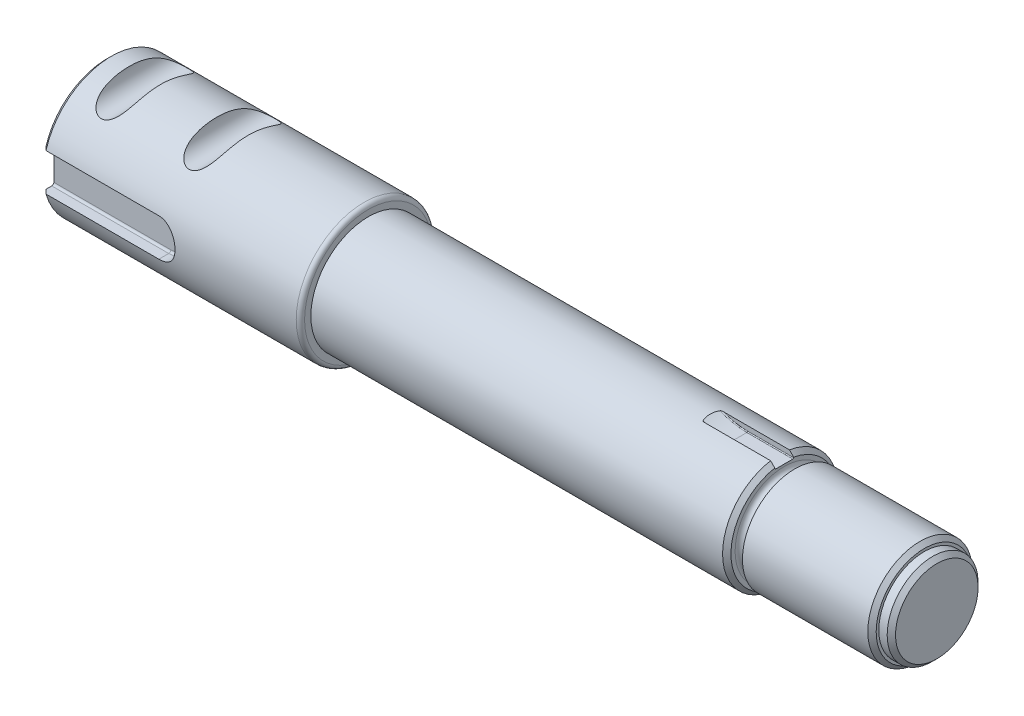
ISO-10303-21;
HEADER;
FILE_DESCRIPTION(('STEP AP214'),'2;1');
FILE_NAME('part.step','',(''),(''),'','','');
FILE_SCHEMA(('AUTOMOTIVE_DESIGN { 1 0 10303 214 1 1 1 1 }'));
ENDSEC;
DATA;
#1=APPLICATION_CONTEXT('core data for automotive mechanical design processes');
#2=APPLICATION_PROTOCOL_DEFINITION('international standard','automotive_design',2000,#1);
#3=PRODUCT_CONTEXT('',#1,'mechanical');
#4=PRODUCT('Part','Part','',(#3));
#5=PRODUCT_RELATED_PRODUCT_CATEGORY('part','',(#4));
#6=PRODUCT_DEFINITION_FORMATION('','',#4);
#7=PRODUCT_DEFINITION_CONTEXT('part definition',#1,'design');
#8=PRODUCT_DEFINITION('design','',#6,#7);
#9=PRODUCT_DEFINITION_SHAPE('','',#8);
#10=(LENGTH_UNIT() NAMED_UNIT(*) SI_UNIT(.MILLI.,.METRE.));
#11=(NAMED_UNIT(*) PLANE_ANGLE_UNIT() SI_UNIT($,.RADIAN.));
#12=(NAMED_UNIT(*) SI_UNIT($,.STERADIAN.) SOLID_ANGLE_UNIT());
#13=UNCERTAINTY_MEASURE_WITH_UNIT(LENGTH_MEASURE(1.E-05),#10,'distance_accuracy_value','');
#14=(GEOMETRIC_REPRESENTATION_CONTEXT(3) GLOBAL_UNCERTAINTY_ASSIGNED_CONTEXT((#13)) GLOBAL_UNIT_ASSIGNED_CONTEXT((#10,
#11,#12)) REPRESENTATION_CONTEXT('',''));
#15=CARTESIAN_POINT('',(0.,0.,0.));
#16=DIRECTION('',(0.,0.,1.));
#17=DIRECTION('',(1.,0.,0.));
#18=AXIS2_PLACEMENT_3D('',#15,#16,#17);
#19=CARTESIAN_POINT('',(0.,0.,0.));
#20=DIRECTION('',(-1.,0.,0.));
#21=DIRECTION('',(0.,0.,1.));
#22=AXIS2_PLACEMENT_3D('',#19,#20,#21);
#23=CYLINDRICAL_SURFACE('',#22,32.5);
#24=CARTESIAN_POINT('',(67.5,-32.5,0.));
#25=CARTESIAN_POINT('',(67.5000014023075,-32.4999997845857,-0.453658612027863));
#26=CARTESIAN_POINT('',(67.5000184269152,-32.4904995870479,-0.907326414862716));
#27=CARTESIAN_POINT('',(67.499873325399,-32.4525142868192,-1.81387717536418));
#28=CARTESIAN_POINT('',(67.499711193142,-32.4240285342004,-2.26676010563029));
#29=CARTESIAN_POINT('',(67.4985579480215,-32.3481057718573,-3.17112711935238));
#30=CARTESIAN_POINT('',(67.4975664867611,-32.3006608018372,-3.62261053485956));
#31=CARTESIAN_POINT('',(67.4936779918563,-32.1869048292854,-4.52317849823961));
#32=CARTESIAN_POINT('',(67.490780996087,-32.1205942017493,-4.97226309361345));
#33=CARTESIAN_POINT('',(67.4815901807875,-31.9694050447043,-5.86618687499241));
#34=CARTESIAN_POINT('',(67.4753043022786,-31.8845701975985,-6.31103352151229));
#35=CARTESIAN_POINT('',(67.4574238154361,-31.6964051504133,-7.19672624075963));
#36=CARTESIAN_POINT('',(67.4458288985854,-31.5930738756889,-7.63757207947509));
#37=CARTESIAN_POINT('',(67.4149837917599,-31.3682387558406,-8.51399477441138));
#38=CARTESIAN_POINT('',(67.3957393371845,-31.2467485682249,-8.94957532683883));
#39=CARTESIAN_POINT('',(67.3467755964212,-30.9858964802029,-9.81469631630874));
#40=CARTESIAN_POINT('',(67.3170583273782,-30.8465380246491,-10.2442378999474));
#41=CARTESIAN_POINT('',(67.2489538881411,-30.5713179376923,-11.0360582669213));
#42=CARTESIAN_POINT('',(67.2123794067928,-30.4377326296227,-11.3992832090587));
#43=CARTESIAN_POINT('',(67.1265340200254,-30.158228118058,-12.1194229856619));
#44=CARTESIAN_POINT('',(67.0772644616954,-30.0123102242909,-12.4763384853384));
#45=CARTESIAN_POINT('',(66.9630389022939,-29.7084965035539,-13.1834597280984));
#46=CARTESIAN_POINT('',(66.8980491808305,-29.5505754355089,-13.5336492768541));
#47=CARTESIAN_POINT('',(66.7491116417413,-29.2240730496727,-14.2249655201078));
#48=CARTESIAN_POINT('',(66.665164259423,-29.0554919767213,-14.566092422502));
#49=CARTESIAN_POINT('',(66.4729606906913,-28.706436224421,-15.242625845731));
#50=CARTESIAN_POINT('',(66.3643378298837,-28.5258146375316,-15.5778541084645));
#51=CARTESIAN_POINT('',(66.1189413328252,-28.157470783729,-16.2341743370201));
#52=CARTESIAN_POINT('',(65.9821556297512,-27.9697455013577,-16.5552601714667));
#53=CARTESIAN_POINT('',(65.6761815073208,-27.5918660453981,-17.1776218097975));
#54=CARTESIAN_POINT('',(65.507167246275,-27.4017298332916,-17.4789928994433));
#55=CARTESIAN_POINT('',(65.1312169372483,-27.0235464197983,-18.0581609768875));
#56=CARTESIAN_POINT('',(64.9243375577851,-26.8354965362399,-18.3359922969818));
#57=CARTESIAN_POINT('',(64.4879019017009,-26.4850166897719,-18.8382413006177));
#58=CARTESIAN_POINT('',(64.261953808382,-26.3217897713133,-19.0652086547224));
#59=CARTESIAN_POINT('',(63.7716882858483,-26.0109060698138,-19.4872095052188));
#60=CARTESIAN_POINT('',(63.5073669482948,-25.8632508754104,-19.6822397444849));
#61=CARTESIAN_POINT('',(63.0812660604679,-25.6603349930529,-19.9451705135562));
#62=CARTESIAN_POINT('',(62.9332920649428,-25.5954501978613,-20.0282963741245));
#63=CARTESIAN_POINT('',(62.628296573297,-25.4736944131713,-20.1829267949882));
#64=CARTESIAN_POINT('',(62.4712804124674,-25.4168187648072,-20.2544381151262));
#65=CARTESIAN_POINT('',(62.1491379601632,-25.3125213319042,-20.384632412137));
#66=CARTESIAN_POINT('',(61.9840181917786,-25.2650920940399,-20.4433255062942));
#67=CARTESIAN_POINT('',(61.6468328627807,-25.1809764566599,-20.5468460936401));
#68=CARTESIAN_POINT('',(61.4747687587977,-25.1442878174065,-20.5916764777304));
#69=CARTESIAN_POINT('',(61.1483436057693,-25.0868320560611,-20.6616220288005));
#70=CARTESIAN_POINT('',(60.9946262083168,-25.0646065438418,-20.6885534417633));
#71=CARTESIAN_POINT('',(60.6845319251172,-25.0296754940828,-20.7308008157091));
#72=CARTESIAN_POINT('',(60.5281552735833,-25.0169691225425,-20.7461177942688));
#73=CARTESIAN_POINT('',(60.2142864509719,-25.0014161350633,-20.7648582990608));
#74=CARTESIAN_POINT('',(60.0567949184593,-24.9985642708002,-20.768288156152));
#75=CARTESIAN_POINT('',(59.7421451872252,-25.0027832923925,-20.7632088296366));
#76=CARTESIAN_POINT('',(59.5849869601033,-25.0098532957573,-20.7547007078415));
#77=CARTESIAN_POINT('',(59.2935597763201,-25.0321126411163,-20.7278456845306));
#78=CARTESIAN_POINT('',(59.1590569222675,-25.0460811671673,-20.7109770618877));
#79=CARTESIAN_POINT('',(58.8922937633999,-25.0810318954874,-20.6686379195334));
#80=CARTESIAN_POINT('',(58.7600341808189,-25.1020163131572,-20.6431646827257));
#81=CARTESIAN_POINT('',(58.4986875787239,-25.1505976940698,-20.5839475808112));
#82=CARTESIAN_POINT('',(58.3695991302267,-25.1781916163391,-20.5502075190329));
#83=CARTESIAN_POINT('',(58.1152141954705,-25.239508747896,-20.4748517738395));
#84=CARTESIAN_POINT('',(57.9899191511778,-25.2732342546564,-20.4332331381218));
#85=CARTESIAN_POINT('',(57.6109181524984,-25.3856924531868,-20.2936265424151));
#86=CARTESIAN_POINT('',(57.3643969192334,-25.473749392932,-20.1832387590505));
#87=CARTESIAN_POINT('',(56.8939633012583,-25.6686327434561,-19.9347964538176));
#88=CARTESIAN_POINT('',(56.6700624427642,-25.7754686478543,-19.7967279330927));
#89=CARTESIAN_POINT('',(56.2950475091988,-25.9763845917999,-19.5319833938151));
#90=CARTESIAN_POINT('',(56.1390587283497,-26.0677205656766,-19.4100285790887));
#91=CARTESIAN_POINT('',(55.8409928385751,-26.2563010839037,-19.1541615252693));
#92=CARTESIAN_POINT('',(55.6989217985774,-26.3535481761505,-19.0202441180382));
#93=CARTESIAN_POINT('',(55.4281074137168,-26.5522222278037,-18.7418990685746));
#94=CARTESIAN_POINT('',(55.2993880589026,-26.6536562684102,-18.5974532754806));
#95=CARTESIAN_POINT('',(55.0548420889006,-26.8589974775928,-18.2996453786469));
#96=CARTESIAN_POINT('',(54.9390198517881,-26.9629054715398,-18.1462802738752));
#97=CARTESIAN_POINT('',(54.6595830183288,-27.2288658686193,-17.7460919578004));
#98=CARTESIAN_POINT('',(54.5043604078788,-27.3917179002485,-17.4939218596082));
#99=CARTESIAN_POINT('',(54.219542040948,-27.7163852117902,-16.9748607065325));
#100=CARTESIAN_POINT('',(54.0899610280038,-27.8781998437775,-16.707961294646));
#101=CARTESIAN_POINT('',(53.8530528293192,-28.1982871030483,-16.1618974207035));
#102=CARTESIAN_POINT('',(53.7457593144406,-28.3565540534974,-15.8827151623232));
#103=CARTESIAN_POINT('',(53.5506268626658,-28.6673444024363,-15.314640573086));
#104=CARTESIAN_POINT('',(53.4627861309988,-28.8198683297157,-15.0257491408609));
#105=CARTESIAN_POINT('',(53.3122792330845,-29.1018950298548,-14.4712092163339));
#106=CARTESIAN_POINT('',(53.2479257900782,-29.2321158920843,-14.2063769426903));
#107=CARTESIAN_POINT('',(53.1307392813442,-29.4862255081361,-13.6711477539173));
#108=CARTESIAN_POINT('',(53.0779080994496,-29.6101132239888,-13.4007499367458));
#109=CARTESIAN_POINT('',(52.9821632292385,-29.8510792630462,-12.8550415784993));
#110=CARTESIAN_POINT('',(52.93925506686,-29.9681537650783,-12.5797283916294));
#111=CARTESIAN_POINT('',(52.861963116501,-30.1950502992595,-12.0249231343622));
#112=CARTESIAN_POINT('',(52.8275803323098,-30.3048714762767,-11.745430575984));
#113=CARTESIAN_POINT('',(52.7660088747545,-30.5171711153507,-11.1822630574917));
#114=CARTESIAN_POINT('',(52.7388344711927,-30.6196347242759,-10.8985809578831));
#115=CARTESIAN_POINT('',(52.6906184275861,-30.8167775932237,-10.3279882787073));
#116=CARTESIAN_POINT('',(52.6695773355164,-30.9114561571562,-10.0410774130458));
#117=CARTESIAN_POINT('',(52.6326080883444,-31.0928391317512,-9.46449527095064));
#118=CARTESIAN_POINT('',(52.6166787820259,-31.1795453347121,-9.17482463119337));
#119=CARTESIAN_POINT('',(52.589012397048,-31.3448887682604,-8.59298727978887));
#120=CARTESIAN_POINT('',(52.5772754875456,-31.4235256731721,-8.30082046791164));
#121=CARTESIAN_POINT('',(52.5522373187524,-31.6092432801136,-7.57028824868));
#122=CARTESIAN_POINT('',(52.5409974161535,-31.7113324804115,-7.13057387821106));
#123=CARTESIAN_POINT('',(52.5236881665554,-31.8971276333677,-6.24716142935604));
#124=CARTESIAN_POINT('',(52.5176192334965,-31.9808321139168,-5.80346303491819));
#125=CARTESIAN_POINT('',(52.5087748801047,-32.1297147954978,-4.9127758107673));
#126=CARTESIAN_POINT('',(52.5060006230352,-32.1948864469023,-4.46578587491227));
#127=CARTESIAN_POINT('',(52.5022874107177,-32.3065432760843,-3.56948410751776));
#128=CARTESIAN_POINT('',(52.5013484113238,-32.3530289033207,-3.12017233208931));
#129=CARTESIAN_POINT('',(52.5002604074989,-32.4272850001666,-2.21939047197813));
#130=CARTESIAN_POINT('',(52.5001124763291,-32.4550299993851,-1.76791828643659));
#131=CARTESIAN_POINT('',(52.4999822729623,-32.4916551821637,-0.86420707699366));
#132=CARTESIAN_POINT('',(52.5000000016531,-32.5005352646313,-0.411968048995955));
#133=CARTESIAN_POINT('',(52.4999999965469,-32.4994149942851,0.492381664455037));
#134=CARTESIAN_POINT('',(52.4999822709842,-32.4894190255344,0.944492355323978));
#135=CARTESIAN_POINT('',(52.5001377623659,-32.4505727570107,1.84790218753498));
#136=CARTESIAN_POINT('',(52.5003109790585,-32.4217224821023,2.29920132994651));
#137=CARTESIAN_POINT('',(52.5015043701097,-32.3449166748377,3.2037492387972));
#138=CARTESIAN_POINT('',(52.5025312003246,-32.2968125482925,3.65698539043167));
#139=CARTESIAN_POINT('',(52.5065403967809,-32.18158835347,4.56103244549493));
#140=CARTESIAN_POINT('',(52.5095227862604,-32.1144680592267,5.01184332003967));
#141=CARTESIAN_POINT('',(52.5189786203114,-31.9612863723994,5.91050505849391));
#142=CARTESIAN_POINT('',(52.5254543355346,-31.8752126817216,6.35835380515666));
#143=CARTESIAN_POINT('',(52.5438702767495,-31.6843247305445,7.24992323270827));
#144=CARTESIAN_POINT('',(52.5558103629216,-31.5795109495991,7.69364401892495));
#145=CARTESIAN_POINT('',(52.5875004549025,-31.3519661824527,8.57378329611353));
#146=CARTESIAN_POINT('',(52.6072103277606,-31.2293292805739,9.01022748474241));
#147=CARTESIAN_POINT('',(52.6573142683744,-30.9660736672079,9.87711886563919));
#148=CARTESIAN_POINT('',(52.6877095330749,-30.8254529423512,10.3075653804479));
#149=CARTESIAN_POINT('',(52.7625401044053,-30.5269773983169,11.1605340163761));
#150=CARTESIAN_POINT('',(52.8069552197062,-30.3691475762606,11.583066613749));
#151=CARTESIAN_POINT('',(52.9138357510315,-30.0369227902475,12.4191554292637));
#152=CARTESIAN_POINT('',(52.9762942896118,-29.8625341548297,12.8327150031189));
#153=CARTESIAN_POINT('',(53.0956180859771,-29.5684322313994,13.4919812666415));
#154=CARTESIAN_POINT('',(53.1454047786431,-29.4534691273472,13.7411032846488));
#155=CARTESIAN_POINT('',(53.2548971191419,-29.2181652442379,14.2345883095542));
#156=CARTESIAN_POINT('',(53.3146020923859,-29.0978248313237,14.4789516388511));
#157=CARTESIAN_POINT('',(53.4453790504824,-28.8522176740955,14.9623895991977));
#158=CARTESIAN_POINT('',(53.5164604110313,-28.7269469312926,15.2014596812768));
#159=CARTESIAN_POINT('',(53.6714948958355,-28.4723152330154,15.6731967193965));
#160=CARTESIAN_POINT('',(53.7554480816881,-28.3429542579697,15.9058636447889));
#161=CARTESIAN_POINT('',(53.9386824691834,-28.0800078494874,16.3656307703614));
#162=CARTESIAN_POINT('',(54.0380886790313,-27.9463957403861,16.592666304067));
#163=CARTESIAN_POINT('',(54.2535529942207,-27.6773392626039,17.0376786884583));
#164=CARTESIAN_POINT('',(54.3696134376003,-27.5418946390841,17.2556542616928));
#165=CARTESIAN_POINT('',(54.6201114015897,-27.2711607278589,17.6804153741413));
#166=CARTESIAN_POINT('',(54.7545214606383,-27.1358715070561,17.8872170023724));
#167=CARTESIAN_POINT('',(55.0436373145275,-26.8676547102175,18.287624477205));
#168=CARTESIAN_POINT('',(55.198332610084,-26.7347259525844,18.4812370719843));
#169=CARTESIAN_POINT('',(55.5789600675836,-26.4354128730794,18.907808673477));
#170=CARTESIAN_POINT('',(55.812414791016,-26.2707940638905,19.1354146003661));
#171=CARTESIAN_POINT('',(56.318764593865,-25.9588628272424,19.5564830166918));
#172=CARTESIAN_POINT('',(56.5916131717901,-25.8115303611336,19.7499851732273));
#173=CARTESIAN_POINT('',(57.0066778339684,-25.6218846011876,19.9944391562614));
#174=CARTESIAN_POINT('',(57.1333944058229,-25.5680389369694,20.063204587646));
#175=CARTESIAN_POINT('',(57.3932711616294,-25.4661954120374,20.1923158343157));
#176=CARTESIAN_POINT('',(57.5264282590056,-25.4181947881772,20.2526656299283));
#177=CARTESIAN_POINT('',(57.7987187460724,-25.3288844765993,20.3642513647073));
#178=CARTESIAN_POINT('',(57.9378533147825,-25.2875761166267,20.4154854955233));
#179=CARTESIAN_POINT('',(58.2212782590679,-25.2125021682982,20.5081274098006));
#180=CARTESIAN_POINT('',(58.3655663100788,-25.1787332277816,20.5495395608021));
#181=CARTESIAN_POINT('',(58.6594387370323,-25.1192462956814,20.622213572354));
#182=CARTESIAN_POINT('',(58.8090533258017,-25.0935868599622,20.6534016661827));
#183=CARTESIAN_POINT('',(59.1114313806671,-25.0512586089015,20.7047229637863));
#184=CARTESIAN_POINT('',(59.2641948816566,-25.0345898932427,20.7248560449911));
#185=CARTESIAN_POINT('',(59.5714689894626,-25.0106676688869,20.7537190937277));
#186=CARTESIAN_POINT('',(59.7259788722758,-25.0034103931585,20.7624536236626));
#187=CARTESIAN_POINT('',(60.0353643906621,-24.9984882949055,20.7683798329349));
#188=CARTESIAN_POINT('',(60.190239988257,-25.0008225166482,20.7655726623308));
#189=CARTESIAN_POINT('',(60.4811567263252,-25.0142003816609,20.7494546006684));
#190=CARTESIAN_POINT('',(60.6173171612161,-25.024212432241,20.7373877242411));
#191=CARTESIAN_POINT('',(60.8878718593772,-25.0514984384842,20.7044170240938));
#192=CARTESIAN_POINT('',(61.022265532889,-25.0687747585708,20.6835103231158));
#193=CARTESIAN_POINT('',(61.288287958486,-25.1102488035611,20.6331400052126));
#194=CARTESIAN_POINT('',(61.4199179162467,-25.1344434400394,20.6036802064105));
#195=CARTESIAN_POINT('',(61.6797146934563,-25.1893077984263,20.5365684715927));
#196=CARTESIAN_POINT('',(61.8078801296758,-25.2199800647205,20.4989133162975));
#197=CARTESIAN_POINT('',(62.1910313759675,-25.3222574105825,20.3726581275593));
#198=CARTESIAN_POINT('',(62.4395850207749,-25.4033062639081,20.2717448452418));
#199=CARTESIAN_POINT('',(62.9153587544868,-25.5851064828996,20.0417983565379));
#200=CARTESIAN_POINT('',(63.142568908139,-25.6858669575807,19.912752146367));
#201=CARTESIAN_POINT('',(63.5199123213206,-25.8748259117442,19.6662435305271));
#202=CARTESIAN_POINT('',(63.6751011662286,-25.9598539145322,19.553969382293));
#203=CARTESIAN_POINT('',(63.9725199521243,-26.1361199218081,19.3177363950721));
#204=CARTESIAN_POINT('',(64.1147482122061,-26.2273587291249,19.1937760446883));
#205=CARTESIAN_POINT('',(64.3867440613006,-26.414460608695,18.935462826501));
#206=CARTESIAN_POINT('',(64.5164855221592,-26.5103327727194,18.8010891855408));
#207=CARTESIAN_POINT('',(64.7636731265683,-26.7049883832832,18.5235621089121));
#208=CARTESIAN_POINT('',(64.8811215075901,-26.8037712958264,18.3804102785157));
#209=CARTESIAN_POINT('',(65.1625032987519,-27.0547890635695,18.0100264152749));
#210=CARTESIAN_POINT('',(65.3188664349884,-27.2081181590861,17.7777676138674));
#211=CARTESIAN_POINT('',(65.6075587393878,-27.5150519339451,17.2989291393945));
#212=CARTESIAN_POINT('',(65.7398747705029,-27.6686567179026,17.0523417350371));
#213=CARTESIAN_POINT('',(65.9833849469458,-27.9737163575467,16.5471570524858));
#214=CARTESIAN_POINT('',(66.0945463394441,-28.125167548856,16.2885419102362));
#215=CARTESIAN_POINT('',(66.2981591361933,-28.4237466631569,15.7617358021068));
#216=CARTESIAN_POINT('',(66.3906120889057,-28.570874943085,15.4935456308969));
#217=CARTESIAN_POINT('',(66.5493911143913,-28.8425114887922,14.9811053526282));
#218=CARTESIAN_POINT('',(66.6175097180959,-28.9676488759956,14.7377366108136));
#219=CARTESIAN_POINT('',(66.7426517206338,-29.2128140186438,14.2455989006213));
#220=CARTESIAN_POINT('',(66.7996733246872,-29.3328409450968,13.9968290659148));
#221=CARTESIAN_POINT('',(66.9040380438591,-29.5672988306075,13.4945065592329));
#222=CARTESIAN_POINT('',(66.9513757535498,-29.6817266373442,13.2409513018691));
#223=CARTESIAN_POINT('',(67.0375977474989,-29.9045297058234,12.7297640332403));
#224=CARTESIAN_POINT('',(67.0764810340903,-30.0129042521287,12.4721315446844));
#225=CARTESIAN_POINT('',(67.1823147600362,-30.3288459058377,11.6929642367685));
#226=CARTESIAN_POINT('',(67.2382812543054,-30.5268339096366,11.1660089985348));
#227=CARTESIAN_POINT('',(67.3288296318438,-30.8955578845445,10.1010967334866));
#228=CARTESIAN_POINT('',(67.3634153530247,-31.066298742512,9.56314169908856));
#229=CARTESIAN_POINT('',(67.4087220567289,-31.3285693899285,8.65537315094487));
#230=CARTESIAN_POINT('',(67.4235475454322,-31.4277705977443,8.28794980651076));
#231=CARTESIAN_POINT('',(67.4479821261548,-31.6132487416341,7.54965988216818));
#232=CARTESIAN_POINT('',(67.4575909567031,-31.6995250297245,7.17879313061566));
#233=CARTESIAN_POINT('',(67.4729889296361,-31.8590228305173,6.4341049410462));
#234=CARTESIAN_POINT('',(67.4787772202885,-31.9322414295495,6.06028286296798));
#235=CARTESIAN_POINT('',(67.4877010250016,-32.0654966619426,5.3102720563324));
#236=CARTESIAN_POINT('',(67.4908365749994,-32.1255334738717,4.93408335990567));
#237=CARTESIAN_POINT('',(67.4954138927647,-32.232363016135,4.1797061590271));
#238=CARTESIAN_POINT('',(67.4968551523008,-32.2791517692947,3.80151708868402));
#239=CARTESIAN_POINT('',(67.4987894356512,-32.3594019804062,3.0437271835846));
#240=CARTESIAN_POINT('',(67.4992824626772,-32.3928634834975,2.66412635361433));
#241=CARTESIAN_POINT('',(67.49985647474,-32.4464158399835,1.90400858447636));
#242=CARTESIAN_POINT('',(67.4999374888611,-32.4665076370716,1.52349171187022));
#243=CARTESIAN_POINT('',(67.5000086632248,-32.4932998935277,0.761985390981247));
#244=CARTESIAN_POINT('',(67.4999988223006,-32.5000001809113,0.38099593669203));
#245=CARTESIAN_POINT('',(67.5,-32.5,0.));
#246=B_SPLINE_CURVE_WITH_KNOTS('',3,(#24,#25,#26,#27,#28,#29,#30,#31,#32,#33,#34,#35,#36,#37,
#38,#39,#40,#41,#42,#43,#44,#45,#46,#47,#48,#49,#50,#51,#52,#53,#54,#55,#56,#57,#58,#59,#60,#61,
#62,#63,#64,#65,#66,#67,#68,#69,#70,#71,#72,#73,#74,#75,#76,#77,#78,#79,#80,#81,#82,#83,#84,#85,
#86,#87,#88,#89,#90,#91,#92,#93,#94,#95,#96,#97,#98,#99,#100,#101,#102,#103,#104,#105,#106,#107,
#108,#109,#110,#111,#112,#113,#114,#115,#116,#117,#118,#119,#120,#121,#122,#123,#124,#125,#126,
#127,#128,#129,#130,#131,#132,#133,#134,#135,#136,#137,#138,#139,#140,#141,#142,#143,#144,#145,
#146,#147,#148,#149,#150,#151,#152,#153,#154,#155,#156,#157,#158,#159,#160,#161,#162,#163,#164,
#165,#166,#167,#168,#169,#170,#171,#172,#173,#174,#175,#176,#177,#178,#179,#180,#181,#182,#183,
#184,#185,#186,#187,#188,#189,#190,#191,#192,#193,#194,#195,#196,#197,#198,#199,#200,#201,#202,
#203,#204,#205,#206,#207,#208,#209,#210,#211,#212,#213,#214,#215,#216,#217,#218,#219,#220,#221,
#222,#223,#224,#225,#226,#227,#228,#229,#230,#231,#232,#233,#234,#235,#236,#237,#238,#239,#240,
#241,#242,#243,#244,#245),.UNSPECIFIED.,.T.,.F.,(4,2,2,2,2,2,2,2,2,2,2,2,2,2,2,2,2,2,2,2,2,2,2,
2,2,2,2,2,2,2,2,2,2,2,2,2,2,2,2,2,2,2,2,2,2,2,2,2,2,2,2,2,2,2,2,2,2,2,2,2,2,2,2,2,2,2,2,2,2,2,2,
2,2,2,2,2,2,2,2,2,2,2,2,2,2,2,2,2,2,2,2,2,2,2,2,2,2,2,2,2,2,2,2,2,2,2,2,2,2,2,4),(0.,
1.3608923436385,2.72183127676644,4.08334222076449,5.44482610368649,6.80313345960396,
8.16151975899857,9.51888949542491,10.8759979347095,12.0417999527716,13.2074783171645,
14.3756796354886,15.5438541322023,16.7306775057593,17.9180104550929,19.0991002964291,
20.2784367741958,21.3537813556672,22.4292355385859,22.9737051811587,23.5178567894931,
24.0615773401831,24.6051844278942,25.0773816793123,25.5495375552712,26.0214419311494,
26.4933043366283,26.9016604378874,27.3101456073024,27.7184431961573,28.1268940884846,
28.9756790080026,29.8248942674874,30.4781776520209,31.1317446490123,31.7864663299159,
32.4414095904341,33.4536032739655,34.4663772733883,35.4806703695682,36.4948698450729,
37.400663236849,38.3066046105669,39.2130492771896,40.1196006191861,41.0279334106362,
41.9363473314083,42.8445565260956,43.7528023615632,45.1069883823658,46.461282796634,
47.8160552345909,49.1707950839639,50.5273724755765,51.8839571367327,53.2402267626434,
54.5964945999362,55.9634379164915,57.3303974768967,58.6982466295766,60.0660607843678,
61.4269005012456,62.7878927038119,64.1469336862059,65.5054573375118,66.3417792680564,
67.1780443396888,68.015002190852,68.8519640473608,69.6960874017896,70.5403293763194,
71.3833214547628,72.2258789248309,73.3182365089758,74.4093150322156,74.8706325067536,
75.331731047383,75.7929209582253,76.2539054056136,76.7181461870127,77.1823921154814,
77.6464521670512,78.1104659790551,78.5211614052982,78.931990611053,79.3426367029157,
79.7534443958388,80.5906133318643,81.4281700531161,82.0560400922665,82.6839914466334,
83.3132294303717,83.942352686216,84.8984906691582,85.8551494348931,86.8132775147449,
87.7713262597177,88.6170099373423,89.462830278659,90.3091214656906,91.15551246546,
92.8511448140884,94.546472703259,95.6888212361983,96.8312270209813,97.9738874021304,
99.1165323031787,100.259519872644,101.402503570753,102.545406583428,103.688324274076),.UNSPECIFIED.);
#247=CARTESIAN_POINT('',(67.5,-32.5,0.));
#248=VERTEX_POINT('',#247);
#249=EDGE_CURVE('E302',#248,#248,#246,.T.);
#250=ORIENTED_EDGE('',*,*,#249,.T.);
#251=EDGE_LOOP('',(#250));
#252=FACE_BOUND('',#251,.T.);
#253=CARTESIAN_POINT('',(25.5,-32.5,0.));
#254=CARTESIAN_POINT('',(25.5000014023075,-32.4999997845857,-0.453658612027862));
#255=CARTESIAN_POINT('',(25.5000184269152,-32.4904995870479,-0.907326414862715));
#256=CARTESIAN_POINT('',(25.499873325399,-32.4525142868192,-1.81387717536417));
#257=CARTESIAN_POINT('',(25.499711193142,-32.4240285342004,-2.26676010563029));
#258=CARTESIAN_POINT('',(25.4985579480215,-32.3481057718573,-3.17112711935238));
#259=CARTESIAN_POINT('',(25.497566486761,-32.3006608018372,-3.62261053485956));
#260=CARTESIAN_POINT('',(25.4936779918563,-32.1869048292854,-4.5231784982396));
#261=CARTESIAN_POINT('',(25.490780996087,-32.1205942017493,-4.97226309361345));
#262=CARTESIAN_POINT('',(25.4815901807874,-31.9694050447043,-5.86618687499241));
#263=CARTESIAN_POINT('',(25.4753043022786,-31.8845701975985,-6.31103352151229));
#264=CARTESIAN_POINT('',(25.457423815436,-31.6964051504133,-7.19672624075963));
#265=CARTESIAN_POINT('',(25.4458288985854,-31.5930738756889,-7.6375720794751));
#266=CARTESIAN_POINT('',(25.4149837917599,-31.3682387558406,-8.51399477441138));
#267=CARTESIAN_POINT('',(25.3957393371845,-31.2467485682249,-8.94957532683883));
#268=CARTESIAN_POINT('',(25.3467755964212,-30.9858964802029,-9.81469631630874));
#269=CARTESIAN_POINT('',(25.3170583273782,-30.8465380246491,-10.2442378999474));
#270=CARTESIAN_POINT('',(25.2489538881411,-30.5713179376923,-11.0360582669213));
#271=CARTESIAN_POINT('',(25.2123794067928,-30.4377326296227,-11.3992832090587));
#272=CARTESIAN_POINT('',(25.1265340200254,-30.158228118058,-12.1194229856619));
#273=CARTESIAN_POINT('',(25.0772644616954,-30.0123102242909,-12.4763384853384));
#274=CARTESIAN_POINT('',(24.9630389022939,-29.7084965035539,-13.1834597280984));
#275=CARTESIAN_POINT('',(24.8980491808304,-29.5505754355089,-13.5336492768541));
#276=CARTESIAN_POINT('',(24.7491116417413,-29.2240730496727,-14.2249655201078));
#277=CARTESIAN_POINT('',(24.6651642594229,-29.0554919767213,-14.566092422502));
#278=CARTESIAN_POINT('',(24.4729606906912,-28.7064362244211,-15.242625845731));
#279=CARTESIAN_POINT('',(24.3643378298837,-28.5258146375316,-15.5778541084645));
#280=CARTESIAN_POINT('',(24.1189413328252,-28.157470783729,-16.2341743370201));
#281=CARTESIAN_POINT('',(23.9821556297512,-27.9697455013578,-16.5552601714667));
#282=CARTESIAN_POINT('',(23.6761815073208,-27.5918660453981,-17.1776218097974));
#283=CARTESIAN_POINT('',(23.507167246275,-27.4017298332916,-17.4789928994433));
#284=CARTESIAN_POINT('',(23.1312169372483,-27.0235464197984,-18.0581609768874));
#285=CARTESIAN_POINT('',(22.9243375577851,-26.8354965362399,-18.3359922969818));
#286=CARTESIAN_POINT('',(22.4879019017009,-26.4850166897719,-18.8382413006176));
#287=CARTESIAN_POINT('',(22.261953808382,-26.3217897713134,-19.0652086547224));
#288=CARTESIAN_POINT('',(21.7716882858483,-26.0109060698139,-19.4872095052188));
#289=CARTESIAN_POINT('',(21.5073669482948,-25.8632508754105,-19.6822397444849));
#290=CARTESIAN_POINT('',(21.0812660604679,-25.6603349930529,-19.9451705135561));
#291=CARTESIAN_POINT('',(20.9332920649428,-25.5954501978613,-20.0282963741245));
#292=CARTESIAN_POINT('',(20.628296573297,-25.4736944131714,-20.1829267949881));
#293=CARTESIAN_POINT('',(20.4712804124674,-25.4168187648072,-20.2544381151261));
#294=CARTESIAN_POINT('',(20.1491379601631,-25.3125213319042,-20.384632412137));
#295=CARTESIAN_POINT('',(19.9840181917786,-25.2650920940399,-20.4433255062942));
#296=CARTESIAN_POINT('',(19.6468328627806,-25.1809764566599,-20.54684609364));
#297=CARTESIAN_POINT('',(19.4747687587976,-25.1442878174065,-20.5916764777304));
#298=CARTESIAN_POINT('',(19.1483436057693,-25.0868320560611,-20.6616220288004));
#299=CARTESIAN_POINT('',(18.9946262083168,-25.0646065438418,-20.6885534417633));
#300=CARTESIAN_POINT('',(18.6845319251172,-25.0296754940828,-20.730800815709));
#301=CARTESIAN_POINT('',(18.5281552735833,-25.0169691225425,-20.7461177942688));
#302=CARTESIAN_POINT('',(18.2142864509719,-25.0014161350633,-20.7648582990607));
#303=CARTESIAN_POINT('',(18.0567949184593,-24.9985642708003,-20.7682881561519));
#304=CARTESIAN_POINT('',(17.7421451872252,-25.0027832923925,-20.7632088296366));
#305=CARTESIAN_POINT('',(17.5849869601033,-25.0098532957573,-20.7547007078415));
#306=CARTESIAN_POINT('',(17.2935597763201,-25.0321126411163,-20.7278456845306));
#307=CARTESIAN_POINT('',(17.1590569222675,-25.0460811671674,-20.7109770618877));
#308=CARTESIAN_POINT('',(16.8922937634,-25.0810318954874,-20.6686379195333));
#309=CARTESIAN_POINT('',(16.7600341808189,-25.1020163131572,-20.6431646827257));
#310=CARTESIAN_POINT('',(16.4986875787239,-25.1505976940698,-20.5839475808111));
#311=CARTESIAN_POINT('',(16.3695991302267,-25.1781916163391,-20.5502075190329));
#312=CARTESIAN_POINT('',(16.1152141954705,-25.239508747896,-20.4748517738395));
#313=CARTESIAN_POINT('',(15.9899191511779,-25.2732342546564,-20.4332331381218));
#314=CARTESIAN_POINT('',(15.6109181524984,-25.3856924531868,-20.2936265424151));
#315=CARTESIAN_POINT('',(15.3643969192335,-25.473749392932,-20.1832387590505));
#316=CARTESIAN_POINT('',(14.8939633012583,-25.6686327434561,-19.9347964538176));
#317=CARTESIAN_POINT('',(14.6700624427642,-25.7754686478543,-19.7967279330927));
#318=CARTESIAN_POINT('',(14.2950475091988,-25.9763845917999,-19.5319833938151));
#319=CARTESIAN_POINT('',(14.1390587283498,-26.0677205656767,-19.4100285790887));
#320=CARTESIAN_POINT('',(13.8409928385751,-26.2563010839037,-19.1541615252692));
#321=CARTESIAN_POINT('',(13.6989217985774,-26.3535481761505,-19.0202441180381));
#322=CARTESIAN_POINT('',(13.4281074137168,-26.5522222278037,-18.7418990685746));
#323=CARTESIAN_POINT('',(13.2993880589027,-26.6536562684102,-18.5974532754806));
#324=CARTESIAN_POINT('',(13.0548420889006,-26.8589974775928,-18.2996453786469));
#325=CARTESIAN_POINT('',(12.9390198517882,-26.9629054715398,-18.1462802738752));
#326=CARTESIAN_POINT('',(12.6595830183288,-27.2288658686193,-17.7460919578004));
#327=CARTESIAN_POINT('',(12.5043604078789,-27.3917179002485,-17.4939218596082));
#328=CARTESIAN_POINT('',(12.2195420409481,-27.7163852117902,-16.9748607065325));
#329=CARTESIAN_POINT('',(12.0899610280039,-27.8781998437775,-16.707961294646));
#330=CARTESIAN_POINT('',(11.8530528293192,-28.1982871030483,-16.1618974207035));
#331=CARTESIAN_POINT('',(11.7457593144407,-28.3565540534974,-15.8827151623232));
#332=CARTESIAN_POINT('',(11.5506268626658,-28.6673444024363,-15.314640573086));
#333=CARTESIAN_POINT('',(11.4627861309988,-28.8198683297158,-15.0257491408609));
#334=CARTESIAN_POINT('',(11.3122792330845,-29.1018950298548,-14.4712092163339));
#335=CARTESIAN_POINT('',(11.2479257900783,-29.2321158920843,-14.2063769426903));
#336=CARTESIAN_POINT('',(11.1307392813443,-29.4862255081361,-13.6711477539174));
#337=CARTESIAN_POINT('',(11.0779080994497,-29.6101132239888,-13.4007499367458));
#338=CARTESIAN_POINT('',(10.9821632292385,-29.8510792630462,-12.8550415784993));
#339=CARTESIAN_POINT('',(10.93925506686,-29.9681537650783,-12.5797283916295));
#340=CARTESIAN_POINT('',(10.861963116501,-30.1950502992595,-12.0249231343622));
#341=CARTESIAN_POINT('',(10.8275803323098,-30.3048714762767,-11.7454305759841));
#342=CARTESIAN_POINT('',(10.7660088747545,-30.5171711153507,-11.1822630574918));
#343=CARTESIAN_POINT('',(10.7388344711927,-30.6196347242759,-10.8985809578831));
#344=CARTESIAN_POINT('',(10.6906184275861,-30.8167775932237,-10.3279882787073));
#345=CARTESIAN_POINT('',(10.6695773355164,-30.9114561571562,-10.0410774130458));
#346=CARTESIAN_POINT('',(10.6326080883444,-31.0928391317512,-9.46449527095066));
#347=CARTESIAN_POINT('',(10.6166787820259,-31.1795453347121,-9.17482463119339));
#348=CARTESIAN_POINT('',(10.589012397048,-31.3448887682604,-8.5929872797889));
#349=CARTESIAN_POINT('',(10.5772754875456,-31.4235256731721,-8.30082046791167));
#350=CARTESIAN_POINT('',(10.5522373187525,-31.6092432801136,-7.57028824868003));
#351=CARTESIAN_POINT('',(10.5409974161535,-31.7113324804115,-7.13057387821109));
#352=CARTESIAN_POINT('',(10.5236881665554,-31.8971276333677,-6.24716142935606));
#353=CARTESIAN_POINT('',(10.5176192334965,-31.9808321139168,-5.80346303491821));
#354=CARTESIAN_POINT('',(10.5087748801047,-32.1297147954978,-4.91277581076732));
#355=CARTESIAN_POINT('',(10.5060006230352,-32.1948864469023,-4.46578587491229));
#356=CARTESIAN_POINT('',(10.5022874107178,-32.3065432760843,-3.56948410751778));
#357=CARTESIAN_POINT('',(10.5013484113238,-32.3530289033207,-3.12017233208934));
#358=CARTESIAN_POINT('',(10.5002604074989,-32.4272850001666,-2.21939047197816));
#359=CARTESIAN_POINT('',(10.5001124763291,-32.4550299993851,-1.76791828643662));
#360=CARTESIAN_POINT('',(10.4999822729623,-32.4916551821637,-0.864207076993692));
#361=CARTESIAN_POINT('',(10.5000000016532,-32.5005352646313,-0.411968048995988));
#362=CARTESIAN_POINT('',(10.4999999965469,-32.4994149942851,0.492381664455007));
#363=CARTESIAN_POINT('',(10.4999822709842,-32.4894190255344,0.944492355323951));
#364=CARTESIAN_POINT('',(10.5001377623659,-32.4505727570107,1.84790218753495));
#365=CARTESIAN_POINT('',(10.5003109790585,-32.4217224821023,2.29920132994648));
#366=CARTESIAN_POINT('',(10.5015043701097,-32.3449166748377,3.20374923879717));
#367=CARTESIAN_POINT('',(10.5025312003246,-32.2968125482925,3.65698539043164));
#368=CARTESIAN_POINT('',(10.5065403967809,-32.18158835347,4.56103244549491));
#369=CARTESIAN_POINT('',(10.5095227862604,-32.1144680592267,5.01184332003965));
#370=CARTESIAN_POINT('',(10.5189786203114,-31.9612863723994,5.91050505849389));
#371=CARTESIAN_POINT('',(10.5254543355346,-31.8752126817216,6.35835380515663));
#372=CARTESIAN_POINT('',(10.5438702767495,-31.6843247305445,7.24992323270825));
#373=CARTESIAN_POINT('',(10.5558103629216,-31.5795109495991,7.69364401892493));
#374=CARTESIAN_POINT('',(10.5875004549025,-31.3519661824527,8.57378329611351));
#375=CARTESIAN_POINT('',(10.6072103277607,-31.2293292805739,9.01022748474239));
#376=CARTESIAN_POINT('',(10.6573142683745,-30.9660736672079,9.87711886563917));
#377=CARTESIAN_POINT('',(10.687709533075,-30.8254529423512,10.3075653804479));
#378=CARTESIAN_POINT('',(10.7625401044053,-30.5269773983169,11.1605340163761));
#379=CARTESIAN_POINT('',(10.8069552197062,-30.3691475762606,11.583066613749));
#380=CARTESIAN_POINT('',(10.9138357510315,-30.0369227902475,12.4191554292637));
#381=CARTESIAN_POINT('',(10.9762942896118,-29.8625341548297,12.8327150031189));
#382=CARTESIAN_POINT('',(11.0956180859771,-29.5684322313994,13.4919812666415));
#383=CARTESIAN_POINT('',(11.1454047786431,-29.4534691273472,13.7411032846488));
#384=CARTESIAN_POINT('',(11.2548971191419,-29.218165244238,14.2345883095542));
#385=CARTESIAN_POINT('',(11.3146020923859,-29.0978248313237,14.4789516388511));
#386=CARTESIAN_POINT('',(11.4453790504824,-28.8522176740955,14.9623895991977));
#387=CARTESIAN_POINT('',(11.5164604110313,-28.7269469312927,15.2014596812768));
#388=CARTESIAN_POINT('',(11.6714948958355,-28.4723152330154,15.6731967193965));
#389=CARTESIAN_POINT('',(11.7554480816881,-28.3429542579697,15.9058636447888));
#390=CARTESIAN_POINT('',(11.9386824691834,-28.0800078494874,16.3656307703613));
#391=CARTESIAN_POINT('',(12.0380886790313,-27.9463957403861,16.592666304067));
#392=CARTESIAN_POINT('',(12.2535529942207,-27.677339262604,17.0376786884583));
#393=CARTESIAN_POINT('',(12.3696134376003,-27.5418946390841,17.2556542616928));
#394=CARTESIAN_POINT('',(12.6201114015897,-27.271160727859,17.6804153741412));
#395=CARTESIAN_POINT('',(12.7545214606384,-27.1358715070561,17.8872170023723));
#396=CARTESIAN_POINT('',(13.0436373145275,-26.8676547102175,18.287624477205));
#397=CARTESIAN_POINT('',(13.198332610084,-26.7347259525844,18.4812370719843));
#398=CARTESIAN_POINT('',(13.5789600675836,-26.4354128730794,18.9078086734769));
#399=CARTESIAN_POINT('',(13.812414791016,-26.2707940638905,19.1354146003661));
#400=CARTESIAN_POINT('',(14.318764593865,-25.9588628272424,19.5564830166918));
#401=CARTESIAN_POINT('',(14.5916131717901,-25.8115303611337,19.7499851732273));
#402=CARTESIAN_POINT('',(15.0066778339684,-25.6218846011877,19.9944391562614));
#403=CARTESIAN_POINT('',(15.1333944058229,-25.5680389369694,20.0632045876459));
#404=CARTESIAN_POINT('',(15.3932711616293,-25.4661954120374,20.1923158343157));
#405=CARTESIAN_POINT('',(15.5264282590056,-25.4181947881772,20.2526656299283));
#406=CARTESIAN_POINT('',(15.7987187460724,-25.3288844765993,20.3642513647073));
#407=CARTESIAN_POINT('',(15.9378533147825,-25.2875761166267,20.4154854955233));
#408=CARTESIAN_POINT('',(16.2212782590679,-25.2125021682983,20.5081274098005));
#409=CARTESIAN_POINT('',(16.3655663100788,-25.1787332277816,20.549539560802));
#410=CARTESIAN_POINT('',(16.6594387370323,-25.1192462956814,20.622213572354));
#411=CARTESIAN_POINT('',(16.8090533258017,-25.0935868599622,20.6534016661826));
#412=CARTESIAN_POINT('',(17.1114313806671,-25.0512586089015,20.7047229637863));
#413=CARTESIAN_POINT('',(17.2641948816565,-25.0345898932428,20.7248560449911));
#414=CARTESIAN_POINT('',(17.5714689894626,-25.0106676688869,20.7537190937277));
#415=CARTESIAN_POINT('',(17.7259788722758,-25.0034103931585,20.7624536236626));
#416=CARTESIAN_POINT('',(18.0353643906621,-24.9984882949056,20.7683798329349));
#417=CARTESIAN_POINT('',(18.190239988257,-25.0008225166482,20.7655726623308));
#418=CARTESIAN_POINT('',(18.4811567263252,-25.014200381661,20.7494546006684));
#419=CARTESIAN_POINT('',(18.6173171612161,-25.024212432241,20.7373877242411));
#420=CARTESIAN_POINT('',(18.8878718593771,-25.0514984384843,20.7044170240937));
#421=CARTESIAN_POINT('',(19.022265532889,-25.0687747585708,20.6835103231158));
#422=CARTESIAN_POINT('',(19.288287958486,-25.1102488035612,20.6331400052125));
#423=CARTESIAN_POINT('',(19.4199179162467,-25.1344434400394,20.6036802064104));
#424=CARTESIAN_POINT('',(19.6797146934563,-25.1893077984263,20.5365684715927));
#425=CARTESIAN_POINT('',(19.8078801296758,-25.2199800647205,20.4989133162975));
#426=CARTESIAN_POINT('',(20.1910313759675,-25.3222574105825,20.3726581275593));
#427=CARTESIAN_POINT('',(20.4395850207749,-25.4033062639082,20.2717448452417));
#428=CARTESIAN_POINT('',(20.9153587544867,-25.5851064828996,20.0417983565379));
#429=CARTESIAN_POINT('',(21.142568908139,-25.6858669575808,19.912752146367));
#430=CARTESIAN_POINT('',(21.5199123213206,-25.8748259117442,19.666243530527));
#431=CARTESIAN_POINT('',(21.6751011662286,-25.9598539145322,19.553969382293));
#432=CARTESIAN_POINT('',(21.9725199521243,-26.1361199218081,19.317736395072));
#433=CARTESIAN_POINT('',(22.1147482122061,-26.2273587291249,19.1937760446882));
#434=CARTESIAN_POINT('',(22.3867440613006,-26.414460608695,18.935462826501));
#435=CARTESIAN_POINT('',(22.5164855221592,-26.5103327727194,18.8010891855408));
#436=CARTESIAN_POINT('',(22.7636731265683,-26.7049883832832,18.523562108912));
#437=CARTESIAN_POINT('',(22.8811215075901,-26.8037712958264,18.3804102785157));
#438=CARTESIAN_POINT('',(23.1625032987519,-27.0547890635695,18.0100264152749));
#439=CARTESIAN_POINT('',(23.3188664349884,-27.2081181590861,17.7777676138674));
#440=CARTESIAN_POINT('',(23.6075587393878,-27.5150519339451,17.2989291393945));
#441=CARTESIAN_POINT('',(23.7398747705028,-27.6686567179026,17.0523417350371));
#442=CARTESIAN_POINT('',(23.9833849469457,-27.9737163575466,16.5471570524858));
#443=CARTESIAN_POINT('',(24.094546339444,-28.125167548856,16.2885419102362));
#444=CARTESIAN_POINT('',(24.2981591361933,-28.4237466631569,15.7617358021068));
#445=CARTESIAN_POINT('',(24.3906120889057,-28.570874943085,15.4935456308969));
#446=CARTESIAN_POINT('',(24.5493911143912,-28.8425114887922,14.9811053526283));
#447=CARTESIAN_POINT('',(24.6175097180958,-28.9676488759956,14.7377366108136));
#448=CARTESIAN_POINT('',(24.7426517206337,-29.2128140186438,14.2455989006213));
#449=CARTESIAN_POINT('',(24.7996733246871,-29.3328409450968,13.9968290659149));
#450=CARTESIAN_POINT('',(24.9040380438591,-29.5672988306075,13.4945065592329));
#451=CARTESIAN_POINT('',(24.9513757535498,-29.6817266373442,13.2409513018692));
#452=CARTESIAN_POINT('',(25.0375977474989,-29.9045297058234,12.7297640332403));
#453=CARTESIAN_POINT('',(25.0764810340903,-30.0129042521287,12.4721315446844));
#454=CARTESIAN_POINT('',(25.1823147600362,-30.3288459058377,11.6929642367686));
#455=CARTESIAN_POINT('',(25.2382812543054,-30.5268339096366,11.1660089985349));
#456=CARTESIAN_POINT('',(25.3288296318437,-30.8955578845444,10.1010967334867));
#457=CARTESIAN_POINT('',(25.3634153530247,-31.066298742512,9.56314169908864));
#458=CARTESIAN_POINT('',(25.4087220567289,-31.3285693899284,8.65537315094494));
#459=CARTESIAN_POINT('',(25.4235475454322,-31.4277705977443,8.28794980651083));
#460=CARTESIAN_POINT('',(25.4479821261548,-31.6132487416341,7.54965988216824));
#461=CARTESIAN_POINT('',(25.4575909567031,-31.6995250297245,7.17879313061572));
#462=CARTESIAN_POINT('',(25.4729889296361,-31.8590228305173,6.43410494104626));
#463=CARTESIAN_POINT('',(25.4787772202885,-31.9322414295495,6.06028286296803));
#464=CARTESIAN_POINT('',(25.4877010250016,-32.0654966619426,5.31027205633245));
#465=CARTESIAN_POINT('',(25.4908365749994,-32.1255334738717,4.93408335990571));
#466=CARTESIAN_POINT('',(25.4954138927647,-32.232363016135,4.17970615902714));
#467=CARTESIAN_POINT('',(25.4968551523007,-32.2791517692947,3.80151708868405));
#468=CARTESIAN_POINT('',(25.4987894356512,-32.3594019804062,3.04372718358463));
#469=CARTESIAN_POINT('',(25.4992824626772,-32.3928634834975,2.66412635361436));
#470=CARTESIAN_POINT('',(25.49985647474,-32.4464158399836,1.90400858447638));
#471=CARTESIAN_POINT('',(25.4999374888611,-32.4665076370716,1.52349171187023));
#472=CARTESIAN_POINT('',(25.5000086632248,-32.4932998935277,0.761985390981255));
#473=CARTESIAN_POINT('',(25.4999988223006,-32.5000001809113,0.380995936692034));
#474=CARTESIAN_POINT('',(25.5,-32.5,0.));
#475=B_SPLINE_CURVE_WITH_KNOTS('',3,(#253,#254,#255,#256,#257,#258,#259,#260,#261,#262,#263,
#264,#265,#266,#267,#268,#269,#270,#271,#272,#273,#274,#275,#276,#277,#278,#279,#280,#281,#282,
#283,#284,#285,#286,#287,#288,#289,#290,#291,#292,#293,#294,#295,#296,#297,#298,#299,#300,#301,
#302,#303,#304,#305,#306,#307,#308,#309,#310,#311,#312,#313,#314,#315,#316,#317,#318,#319,#320,
#321,#322,#323,#324,#325,#326,#327,#328,#329,#330,#331,#332,#333,#334,#335,#336,#337,#338,#339,
#340,#341,#342,#343,#344,#345,#346,#347,#348,#349,#350,#351,#352,#353,#354,#355,#356,#357,#358,
#359,#360,#361,#362,#363,#364,#365,#366,#367,#368,#369,#370,#371,#372,#373,#374,#375,#376,#377,
#378,#379,#380,#381,#382,#383,#384,#385,#386,#387,#388,#389,#390,#391,#392,#393,#394,#395,#396,
#397,#398,#399,#400,#401,#402,#403,#404,#405,#406,#407,#408,#409,#410,#411,#412,#413,#414,#415,
#416,#417,#418,#419,#420,#421,#422,#423,#424,#425,#426,#427,#428,#429,#430,#431,#432,#433,#434,
#435,#436,#437,#438,#439,#440,#441,#442,#443,#444,#445,#446,#447,#448,#449,#450,#451,#452,#453,
#454,#455,#456,#457,#458,#459,#460,#461,#462,#463,#464,#465,#466,#467,#468,#469,#470,#471,#472,
#473,#474),.UNSPECIFIED.,.T.,.F.,(4,2,2,2,2,2,2,2,2,2,2,2,2,2,2,2,2,2,2,2,2,2,2,2,2,2,2,2,2,2,2,
2,2,2,2,2,2,2,2,2,2,2,2,2,2,2,2,2,2,2,2,2,2,2,2,2,2,2,2,2,2,2,2,2,2,2,2,2,2,2,2,2,2,2,2,2,2,2,2,
2,2,2,2,2,2,2,2,2,2,2,2,2,2,2,2,2,2,2,2,2,2,2,2,2,2,2,2,2,2,2,4),(0.,1.3608923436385,
2.72183127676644,4.08334222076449,5.44482610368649,6.80313345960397,8.16151975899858,
9.51888949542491,10.8759979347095,12.0417999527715,13.2074783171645,14.3756796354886,
15.5438541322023,16.7306775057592,17.9180104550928,19.0991002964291,20.2784367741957,
21.3537813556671,22.4292355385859,22.9737051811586,23.5178567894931,24.061577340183,
24.6051844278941,25.0773816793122,25.5495375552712,26.0214419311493,26.4933043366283,
26.9016604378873,27.3101456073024,27.7184431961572,28.1268940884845,28.9756790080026,
29.8248942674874,30.4781776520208,31.1317446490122,31.7864663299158,32.441409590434,
33.4536032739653,34.4663772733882,35.480670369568,36.4948698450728,37.4006632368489,
38.3066046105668,39.2130492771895,40.119600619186,41.027933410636,41.9363473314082,
42.8445565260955,43.7528023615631,45.1069883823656,46.4612827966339,47.8160552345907,
49.1707950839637,50.5273724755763,51.8839571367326,53.2402267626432,54.5964945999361,
55.9634379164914,57.3303974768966,58.6982466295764,60.0660607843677,61.4269005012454,
62.7878927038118,64.1469336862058,65.5054573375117,66.3417792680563,67.1780443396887,
68.0150021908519,68.8519640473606,69.6960874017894,70.5403293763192,71.3833214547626,
72.2258789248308,73.3182365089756,74.4093150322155,74.8706325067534,75.3317310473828,
75.7929209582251,76.2539054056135,76.7181461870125,77.1823921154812,77.6464521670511,
78.1104659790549,78.521161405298,78.9319906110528,79.3426367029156,79.7534443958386,
80.5906133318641,81.4281700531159,82.0560400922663,82.6839914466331,83.3132294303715,
83.9423526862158,84.8984906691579,85.8551494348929,86.8132775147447,87.7713262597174,
88.6170099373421,89.4628302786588,90.3091214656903,91.1555124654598,92.8511448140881,
94.5464727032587,95.6888212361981,96.8312270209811,97.9738874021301,99.1165323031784,
100.259519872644,101.402503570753,102.545406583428,103.688324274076),.UNSPECIFIED.);
#476=CARTESIAN_POINT('',(25.5,-32.5,0.));
#477=VERTEX_POINT('',#476);
#478=EDGE_CURVE('E306',#477,#477,#475,.T.);
#479=ORIENTED_EDGE('',*,*,#478,.T.);
#480=EDGE_LOOP('',(#479));
#481=FACE_BOUND('',#480,.T.);
#482=CARTESIAN_POINT('',(67.5,32.5,0.));
#483=CARTESIAN_POINT('',(67.5000014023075,32.4999997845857,0.453658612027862));
#484=CARTESIAN_POINT('',(67.5000184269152,32.4904995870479,0.907326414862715));
#485=CARTESIAN_POINT('',(67.499873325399,32.4525142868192,1.81387717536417));
#486=CARTESIAN_POINT('',(67.499711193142,32.4240285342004,2.26676010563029));
#487=CARTESIAN_POINT('',(67.4985579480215,32.3481057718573,3.17112711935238));
#488=CARTESIAN_POINT('',(67.4975664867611,32.3006608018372,3.62261053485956));
#489=CARTESIAN_POINT('',(67.4936779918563,32.1869048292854,4.5231784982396));
#490=CARTESIAN_POINT('',(67.490780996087,32.1205942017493,4.97226309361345));
#491=CARTESIAN_POINT('',(67.4815901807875,31.9694050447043,5.86618687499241));
#492=CARTESIAN_POINT('',(67.4753043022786,31.8845701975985,6.31103352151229));
#493=CARTESIAN_POINT('',(67.4574238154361,31.6964051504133,7.19672624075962));
#494=CARTESIAN_POINT('',(67.4458288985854,31.5930738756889,7.63757207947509));
#495=CARTESIAN_POINT('',(67.4149837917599,31.3682387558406,8.51399477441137));
#496=CARTESIAN_POINT('',(67.3957393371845,31.2467485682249,8.94957532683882));
#497=CARTESIAN_POINT('',(67.3467755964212,30.9858964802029,9.81469631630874));
#498=CARTESIAN_POINT('',(67.3170583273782,30.8465380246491,10.2442378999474));
#499=CARTESIAN_POINT('',(67.2489538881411,30.5713179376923,11.0360582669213));
#500=CARTESIAN_POINT('',(67.2123794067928,30.4377326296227,11.3992832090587));
#501=CARTESIAN_POINT('',(67.1265340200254,30.158228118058,12.1194229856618));
#502=CARTESIAN_POINT('',(67.0772644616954,30.0123102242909,12.4763384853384));
#503=CARTESIAN_POINT('',(66.9630389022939,29.7084965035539,13.1834597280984));
#504=CARTESIAN_POINT('',(66.8980491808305,29.5505754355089,13.5336492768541));
#505=CARTESIAN_POINT('',(66.7491116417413,29.2240730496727,14.2249655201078));
#506=CARTESIAN_POINT('',(66.665164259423,29.0554919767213,14.566092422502));
#507=CARTESIAN_POINT('',(66.4729606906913,28.7064362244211,15.242625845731));
#508=CARTESIAN_POINT('',(66.3643378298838,28.5258146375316,15.5778541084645));
#509=CARTESIAN_POINT('',(66.1189413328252,28.157470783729,16.2341743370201));
#510=CARTESIAN_POINT('',(65.9821556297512,27.9697455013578,16.5552601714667));
#511=CARTESIAN_POINT('',(65.6761815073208,27.5918660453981,17.1776218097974));
#512=CARTESIAN_POINT('',(65.507167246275,27.4017298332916,17.4789928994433));
#513=CARTESIAN_POINT('',(65.1312169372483,27.0235464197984,18.0581609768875));
#514=CARTESIAN_POINT('',(64.9243375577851,26.8354965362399,18.3359922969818));
#515=CARTESIAN_POINT('',(64.4879019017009,26.4850166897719,18.8382413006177));
#516=CARTESIAN_POINT('',(64.261953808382,26.3217897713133,19.0652086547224));
#517=CARTESIAN_POINT('',(63.7716882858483,26.0109060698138,19.4872095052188));
#518=CARTESIAN_POINT('',(63.5073669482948,25.8632508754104,19.6822397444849));
#519=CARTESIAN_POINT('',(63.0812660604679,25.6603349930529,19.9451705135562));
#520=CARTESIAN_POINT('',(62.9332920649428,25.5954501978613,20.0282963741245));
#521=CARTESIAN_POINT('',(62.628296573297,25.4736944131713,20.1829267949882));
#522=CARTESIAN_POINT('',(62.4712804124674,25.4168187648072,20.2544381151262));
#523=CARTESIAN_POINT('',(62.1491379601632,25.3125213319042,20.384632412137));
#524=CARTESIAN_POINT('',(61.9840181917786,25.2650920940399,20.4433255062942));
#525=CARTESIAN_POINT('',(61.6468328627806,25.1809764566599,20.5468460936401));
#526=CARTESIAN_POINT('',(61.4747687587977,25.1442878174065,20.5916764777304));
#527=CARTESIAN_POINT('',(61.1483436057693,25.0868320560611,20.6616220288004));
#528=CARTESIAN_POINT('',(60.9946262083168,25.0646065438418,20.6885534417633));
#529=CARTESIAN_POINT('',(60.6845319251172,25.0296754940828,20.7308008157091));
#530=CARTESIAN_POINT('',(60.5281552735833,25.0169691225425,20.7461177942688));
#531=CARTESIAN_POINT('',(60.2142864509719,25.0014161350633,20.7648582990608));
#532=CARTESIAN_POINT('',(60.0567949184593,24.9985642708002,20.768288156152));
#533=CARTESIAN_POINT('',(59.7421451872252,25.0027832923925,20.7632088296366));
#534=CARTESIAN_POINT('',(59.5849869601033,25.0098532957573,20.7547007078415));
#535=CARTESIAN_POINT('',(59.2935597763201,25.0321126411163,20.7278456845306));
#536=CARTESIAN_POINT('',(59.1590569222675,25.0460811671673,20.7109770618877));
#537=CARTESIAN_POINT('',(58.8922937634,25.0810318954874,20.6686379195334));
#538=CARTESIAN_POINT('',(58.7600341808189,25.1020163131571,20.6431646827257));
#539=CARTESIAN_POINT('',(58.4986875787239,25.1505976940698,20.5839475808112));
#540=CARTESIAN_POINT('',(58.3695991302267,25.1781916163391,20.5502075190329));
#541=CARTESIAN_POINT('',(58.1152141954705,25.2395087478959,20.4748517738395));
#542=CARTESIAN_POINT('',(57.9899191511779,25.2732342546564,20.4332331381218));
#543=CARTESIAN_POINT('',(57.6109181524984,25.3856924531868,20.2936265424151));
#544=CARTESIAN_POINT('',(57.3643969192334,25.473749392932,20.1832387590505));
#545=CARTESIAN_POINT('',(56.8939633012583,25.6686327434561,19.9347964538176));
#546=CARTESIAN_POINT('',(56.6700624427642,25.7754686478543,19.7967279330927));
#547=CARTESIAN_POINT('',(56.2950475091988,25.9763845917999,19.5319833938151));
#548=CARTESIAN_POINT('',(56.1390587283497,26.0677205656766,19.4100285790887));
#549=CARTESIAN_POINT('',(55.8409928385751,26.2563010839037,19.1541615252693));
#550=CARTESIAN_POINT('',(55.6989217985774,26.3535481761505,19.0202441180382));
#551=CARTESIAN_POINT('',(55.4281074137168,26.5522222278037,18.7418990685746));
#552=CARTESIAN_POINT('',(55.2993880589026,26.6536562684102,18.5974532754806));
#553=CARTESIAN_POINT('',(55.0548420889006,26.8589974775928,18.2996453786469));
#554=CARTESIAN_POINT('',(54.9390198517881,26.9629054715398,18.1462802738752));
#555=CARTESIAN_POINT('',(54.6595830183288,27.2288658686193,17.7460919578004));
#556=CARTESIAN_POINT('',(54.5043604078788,27.3917179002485,17.4939218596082));
#557=CARTESIAN_POINT('',(54.219542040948,27.7163852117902,16.9748607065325));
#558=CARTESIAN_POINT('',(54.0899610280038,27.8781998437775,16.707961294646));
#559=CARTESIAN_POINT('',(53.8530528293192,28.1982871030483,16.1618974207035));
#560=CARTESIAN_POINT('',(53.7457593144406,28.3565540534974,15.8827151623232));
#561=CARTESIAN_POINT('',(53.5506268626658,28.6673444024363,15.314640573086));
#562=CARTESIAN_POINT('',(53.4627861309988,28.8198683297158,15.0257491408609));
#563=CARTESIAN_POINT('',(53.3122792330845,29.1018950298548,14.4712092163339));
#564=CARTESIAN_POINT('',(53.2479257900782,29.2321158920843,14.2063769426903));
#565=CARTESIAN_POINT('',(53.1307392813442,29.4862255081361,13.6711477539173));
#566=CARTESIAN_POINT('',(53.0779080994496,29.6101132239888,13.4007499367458));
#567=CARTESIAN_POINT('',(52.9821632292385,29.8510792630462,12.8550415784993));
#568=CARTESIAN_POINT('',(52.93925506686,29.9681537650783,12.5797283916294));
#569=CARTESIAN_POINT('',(52.861963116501,30.1950502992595,12.0249231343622));
#570=CARTESIAN_POINT('',(52.8275803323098,30.3048714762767,11.745430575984));
#571=CARTESIAN_POINT('',(52.7660088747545,30.5171711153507,11.1822630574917));
#572=CARTESIAN_POINT('',(52.7388344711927,30.6196347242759,10.8985809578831));
#573=CARTESIAN_POINT('',(52.6906184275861,30.8167775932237,10.3279882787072));
#574=CARTESIAN_POINT('',(52.6695773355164,30.9114561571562,10.0410774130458));
#575=CARTESIAN_POINT('',(52.6326080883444,31.0928391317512,9.46449527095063));
#576=CARTESIAN_POINT('',(52.6166787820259,31.1795453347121,9.17482463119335));
#577=CARTESIAN_POINT('',(52.589012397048,31.3448887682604,8.59298727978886));
#578=CARTESIAN_POINT('',(52.5772754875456,31.4235256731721,8.30082046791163));
#579=CARTESIAN_POINT('',(52.5522373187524,31.6092432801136,7.57028824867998));
#580=CARTESIAN_POINT('',(52.5409974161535,31.7113324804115,7.13057387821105));
#581=CARTESIAN_POINT('',(52.5236881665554,31.8971276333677,6.24716142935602));
#582=CARTESIAN_POINT('',(52.5176192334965,31.9808321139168,5.80346303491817));
#583=CARTESIAN_POINT('',(52.5087748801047,32.1297147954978,4.91277581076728));
#584=CARTESIAN_POINT('',(52.5060006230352,32.1948864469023,4.46578587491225));
#585=CARTESIAN_POINT('',(52.5022874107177,32.3065432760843,3.56948410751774));
#586=CARTESIAN_POINT('',(52.5013484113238,32.3530289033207,3.12017233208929));
#587=CARTESIAN_POINT('',(52.5002604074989,32.4272850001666,2.21939047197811));
#588=CARTESIAN_POINT('',(52.5001124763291,32.4550299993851,1.76791828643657));
#589=CARTESIAN_POINT('',(52.4999822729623,32.4916551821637,0.864207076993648));
#590=CARTESIAN_POINT('',(52.5000000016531,32.5005352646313,0.411968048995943));
#591=CARTESIAN_POINT('',(52.4999999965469,32.4994149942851,-0.492381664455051));
#592=CARTESIAN_POINT('',(52.4999822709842,32.4894190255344,-0.944492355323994));
#593=CARTESIAN_POINT('',(52.5001377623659,32.4505727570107,-1.847902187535));
#594=CARTESIAN_POINT('',(52.5003109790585,32.4217224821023,-2.29920132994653));
#595=CARTESIAN_POINT('',(52.5015043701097,32.3449166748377,-3.20374923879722));
#596=CARTESIAN_POINT('',(52.5025312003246,32.2968125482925,-3.65698539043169));
#597=CARTESIAN_POINT('',(52.5065403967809,32.18158835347,-4.56103244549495));
#598=CARTESIAN_POINT('',(52.5095227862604,32.1144680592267,-5.01184332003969));
#599=CARTESIAN_POINT('',(52.5189786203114,31.9612863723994,-5.91050505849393));
#600=CARTESIAN_POINT('',(52.5254543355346,31.8752126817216,-6.35835380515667));
#601=CARTESIAN_POINT('',(52.5438702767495,31.6843247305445,-7.24992323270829));
#602=CARTESIAN_POINT('',(52.5558103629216,31.5795109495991,-7.69364401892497));
#603=CARTESIAN_POINT('',(52.5875004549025,31.3519661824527,-8.57378329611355));
#604=CARTESIAN_POINT('',(52.6072103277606,31.2293292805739,-9.01022748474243));
#605=CARTESIAN_POINT('',(52.6573142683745,30.9660736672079,-9.87711886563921));
#606=CARTESIAN_POINT('',(52.687709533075,30.8254529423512,-10.3075653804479));
#607=CARTESIAN_POINT('',(52.7625401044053,30.5269773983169,-11.1605340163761));
#608=CARTESIAN_POINT('',(52.8069552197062,30.3691475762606,-11.583066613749));
#609=CARTESIAN_POINT('',(52.9138357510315,30.0369227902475,-12.4191554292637));
#610=CARTESIAN_POINT('',(52.9762942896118,29.8625341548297,-12.832715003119));
#611=CARTESIAN_POINT('',(53.0956180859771,29.5684322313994,-13.4919812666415));
#612=CARTESIAN_POINT('',(53.1454047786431,29.4534691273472,-13.7411032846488));
#613=CARTESIAN_POINT('',(53.2548971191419,29.2181652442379,-14.2345883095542));
#614=CARTESIAN_POINT('',(53.3146020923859,29.0978248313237,-14.4789516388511));
#615=CARTESIAN_POINT('',(53.4453790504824,28.8522176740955,-14.9623895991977));
#616=CARTESIAN_POINT('',(53.5164604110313,28.7269469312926,-15.2014596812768));
#617=CARTESIAN_POINT('',(53.6714948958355,28.4723152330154,-15.6731967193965));
#618=CARTESIAN_POINT('',(53.7554480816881,28.3429542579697,-15.9058636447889));
#619=CARTESIAN_POINT('',(53.9386824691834,28.0800078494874,-16.3656307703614));
#620=CARTESIAN_POINT('',(54.0380886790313,27.9463957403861,-16.592666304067));
#621=CARTESIAN_POINT('',(54.2535529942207,27.6773392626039,-17.0376786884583));
#622=CARTESIAN_POINT('',(54.3696134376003,27.5418946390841,-17.2556542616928));
#623=CARTESIAN_POINT('',(54.6201114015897,27.2711607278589,-17.6804153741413));
#624=CARTESIAN_POINT('',(54.7545214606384,27.1358715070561,-17.8872170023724));
#625=CARTESIAN_POINT('',(55.0436373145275,26.8676547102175,-18.287624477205));
#626=CARTESIAN_POINT('',(55.198332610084,26.7347259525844,-18.4812370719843));
#627=CARTESIAN_POINT('',(55.5789600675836,26.4354128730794,-18.907808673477));
#628=CARTESIAN_POINT('',(55.812414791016,26.2707940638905,-19.1354146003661));
#629=CARTESIAN_POINT('',(56.318764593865,25.9588628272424,-19.5564830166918));
#630=CARTESIAN_POINT('',(56.5916131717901,25.8115303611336,-19.7499851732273));
#631=CARTESIAN_POINT('',(57.0066778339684,25.6218846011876,-19.9944391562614));
#632=CARTESIAN_POINT('',(57.1333944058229,25.5680389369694,-20.063204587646));
#633=CARTESIAN_POINT('',(57.3932711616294,25.4661954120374,-20.1923158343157));
#634=CARTESIAN_POINT('',(57.5264282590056,25.4181947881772,-20.2526656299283));
#635=CARTESIAN_POINT('',(57.7987187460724,25.3288844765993,-20.3642513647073));
#636=CARTESIAN_POINT('',(57.9378533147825,25.2875761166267,-20.4154854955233));
#637=CARTESIAN_POINT('',(58.2212782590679,25.2125021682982,-20.5081274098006));
#638=CARTESIAN_POINT('',(58.3655663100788,25.1787332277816,-20.5495395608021));
#639=CARTESIAN_POINT('',(58.6594387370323,25.1192462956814,-20.622213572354));
#640=CARTESIAN_POINT('',(58.8090533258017,25.0935868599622,-20.6534016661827));
#641=CARTESIAN_POINT('',(59.1114313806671,25.0512586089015,-20.7047229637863));
#642=CARTESIAN_POINT('',(59.2641948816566,25.0345898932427,-20.7248560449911));
#643=CARTESIAN_POINT('',(59.5714689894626,25.0106676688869,-20.7537190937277));
#644=CARTESIAN_POINT('',(59.7259788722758,25.0034103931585,-20.7624536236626));
#645=CARTESIAN_POINT('',(60.0353643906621,24.9984882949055,-20.7683798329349));
#646=CARTESIAN_POINT('',(60.190239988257,25.0008225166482,-20.7655726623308));
#647=CARTESIAN_POINT('',(60.4811567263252,25.0142003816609,-20.7494546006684));
#648=CARTESIAN_POINT('',(60.6173171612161,25.024212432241,-20.7373877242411));
#649=CARTESIAN_POINT('',(60.8878718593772,25.0514984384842,-20.7044170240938));
#650=CARTESIAN_POINT('',(61.022265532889,25.0687747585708,-20.6835103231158));
#651=CARTESIAN_POINT('',(61.288287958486,25.1102488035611,-20.6331400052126));
#652=CARTESIAN_POINT('',(61.4199179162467,25.1344434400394,-20.6036802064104));
#653=CARTESIAN_POINT('',(61.6797146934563,25.1893077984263,-20.5365684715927));
#654=CARTESIAN_POINT('',(61.8078801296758,25.2199800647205,-20.4989133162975));
#655=CARTESIAN_POINT('',(62.1910313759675,25.3222574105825,-20.3726581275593));
#656=CARTESIAN_POINT('',(62.4395850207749,25.4033062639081,-20.2717448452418));
#657=CARTESIAN_POINT('',(62.9153587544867,25.5851064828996,-20.0417983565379));
#658=CARTESIAN_POINT('',(63.142568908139,25.6858669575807,-19.912752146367));
#659=CARTESIAN_POINT('',(63.5199123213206,25.8748259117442,-19.6662435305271));
#660=CARTESIAN_POINT('',(63.6751011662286,25.9598539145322,-19.5539693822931));
#661=CARTESIAN_POINT('',(63.9725199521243,26.1361199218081,-19.3177363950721));
#662=CARTESIAN_POINT('',(64.1147482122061,26.2273587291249,-19.1937760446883));
#663=CARTESIAN_POINT('',(64.3867440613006,26.414460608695,-18.935462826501));
#664=CARTESIAN_POINT('',(64.5164855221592,26.5103327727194,-18.8010891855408));
#665=CARTESIAN_POINT('',(64.7636731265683,26.7049883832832,-18.5235621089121));
#666=CARTESIAN_POINT('',(64.8811215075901,26.8037712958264,-18.3804102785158));
#667=CARTESIAN_POINT('',(65.1625032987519,27.0547890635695,-18.0100264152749));
#668=CARTESIAN_POINT('',(65.3188664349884,27.2081181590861,-17.7777676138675));
#669=CARTESIAN_POINT('',(65.6075587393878,27.5150519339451,-17.2989291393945));
#670=CARTESIAN_POINT('',(65.7398747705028,27.6686567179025,-17.0523417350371));
#671=CARTESIAN_POINT('',(65.9833849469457,27.9737163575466,-16.5471570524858));
#672=CARTESIAN_POINT('',(66.094546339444,28.125167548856,-16.2885419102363));
#673=CARTESIAN_POINT('',(66.2981591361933,28.4237466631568,-15.7617358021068));
#674=CARTESIAN_POINT('',(66.3906120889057,28.570874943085,-15.493545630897));
#675=CARTESIAN_POINT('',(66.5493911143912,28.8425114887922,-14.9811053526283));
#676=CARTESIAN_POINT('',(66.6175097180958,28.9676488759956,-14.7377366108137));
#677=CARTESIAN_POINT('',(66.7426517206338,29.2128140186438,-14.2455989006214));
#678=CARTESIAN_POINT('',(66.7996733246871,29.3328409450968,-13.9968290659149));
#679=CARTESIAN_POINT('',(66.9040380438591,29.5672988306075,-13.494506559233));
#680=CARTESIAN_POINT('',(66.9513757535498,29.6817266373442,-13.2409513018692));
#681=CARTESIAN_POINT('',(67.0375977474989,29.9045297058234,-12.7297640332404));
#682=CARTESIAN_POINT('',(67.0764810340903,30.0129042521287,-12.4721315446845));
#683=CARTESIAN_POINT('',(67.1823147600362,30.3288459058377,-11.6929642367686));
#684=CARTESIAN_POINT('',(67.2382812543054,30.5268339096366,-11.166008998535));
#685=CARTESIAN_POINT('',(67.3288296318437,30.8955578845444,-10.1010967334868));
#686=CARTESIAN_POINT('',(67.3634153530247,31.0662987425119,-9.56314169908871));
#687=CARTESIAN_POINT('',(67.4087220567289,31.3285693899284,-8.65537315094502));
#688=CARTESIAN_POINT('',(67.4235475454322,31.4277705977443,-8.28794980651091));
#689=CARTESIAN_POINT('',(67.4479821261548,31.6132487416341,-7.54965988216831));
#690=CARTESIAN_POINT('',(67.4575909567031,31.6995250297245,-7.17879313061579));
#691=CARTESIAN_POINT('',(67.4729889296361,31.8590228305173,-6.43410494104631));
#692=CARTESIAN_POINT('',(67.4787772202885,31.9322414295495,-6.06028286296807));
#693=CARTESIAN_POINT('',(67.4877010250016,32.0654966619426,-5.31027205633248));
#694=CARTESIAN_POINT('',(67.4908365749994,32.1255334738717,-4.93408335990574));
#695=CARTESIAN_POINT('',(67.4954138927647,32.232363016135,-4.17970615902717));
#696=CARTESIAN_POINT('',(67.4968551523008,32.2791517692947,-3.80151708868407));
#697=CARTESIAN_POINT('',(67.4987894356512,32.3594019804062,-3.04372718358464));
#698=CARTESIAN_POINT('',(67.4992824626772,32.3928634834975,-2.66412635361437));
#699=CARTESIAN_POINT('',(67.49985647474,32.4464158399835,-1.90400858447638));
#700=CARTESIAN_POINT('',(67.4999374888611,32.4665076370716,-1.52349171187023));
#701=CARTESIAN_POINT('',(67.5000086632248,32.4932998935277,-0.761985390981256));
#702=CARTESIAN_POINT('',(67.4999988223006,32.5000001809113,-0.380995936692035));
#703=CARTESIAN_POINT('',(67.5,32.5,0.));
#704=B_SPLINE_CURVE_WITH_KNOTS('',3,(#482,#483,#484,#485,#486,#487,#488,#489,#490,#491,#492,
#493,#494,#495,#496,#497,#498,#499,#500,#501,#502,#503,#504,#505,#506,#507,#508,#509,#510,#511,
#512,#513,#514,#515,#516,#517,#518,#519,#520,#521,#522,#523,#524,#525,#526,#527,#528,#529,#530,
#531,#532,#533,#534,#535,#536,#537,#538,#539,#540,#541,#542,#543,#544,#545,#546,#547,#548,#549,
#550,#551,#552,#553,#554,#555,#556,#557,#558,#559,#560,#561,#562,#563,#564,#565,#566,#567,#568,
#569,#570,#571,#572,#573,#574,#575,#576,#577,#578,#579,#580,#581,#582,#583,#584,#585,#586,#587,
#588,#589,#590,#591,#592,#593,#594,#595,#596,#597,#598,#599,#600,#601,#602,#603,#604,#605,#606,
#607,#608,#609,#610,#611,#612,#613,#614,#615,#616,#617,#618,#619,#620,#621,#622,#623,#624,#625,
#626,#627,#628,#629,#630,#631,#632,#633,#634,#635,#636,#637,#638,#639,#640,#641,#642,#643,#644,
#645,#646,#647,#648,#649,#650,#651,#652,#653,#654,#655,#656,#657,#658,#659,#660,#661,#662,#663,
#664,#665,#666,#667,#668,#669,#670,#671,#672,#673,#674,#675,#676,#677,#678,#679,#680,#681,#682,
#683,#684,#685,#686,#687,#688,#689,#690,#691,#692,#693,#694,#695,#696,#697,#698,#699,#700,#701,
#702,#703),.UNSPECIFIED.,.T.,.F.,(4,2,2,2,2,2,2,2,2,2,2,2,2,2,2,2,2,2,2,2,2,2,2,2,2,2,2,2,2,2,2,
2,2,2,2,2,2,2,2,2,2,2,2,2,2,2,2,2,2,2,2,2,2,2,2,2,2,2,2,2,2,2,2,2,2,2,2,2,2,2,2,2,2,2,2,2,2,2,2,
2,2,2,2,2,2,2,2,2,2,2,2,2,2,2,2,2,2,2,2,2,2,2,2,2,2,2,2,2,2,2,4),(0.,1.3608923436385,
2.72183127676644,4.08334222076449,5.44482610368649,6.80313345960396,8.16151975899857,
9.5188894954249,10.8759979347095,12.0417999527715,13.2074783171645,14.3756796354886,
15.5438541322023,16.7306775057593,17.9180104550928,19.0991002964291,20.2784367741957,
21.3537813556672,22.4292355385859,22.9737051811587,23.5178567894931,24.0615773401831,
24.6051844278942,25.0773816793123,25.5495375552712,26.0214419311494,26.4933043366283,
26.9016604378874,27.3101456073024,27.7184431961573,28.1268940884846,28.9756790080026,
29.8248942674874,30.4781776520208,31.1317446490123,31.7864663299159,32.441409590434,
33.4536032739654,34.4663772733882,35.4806703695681,36.4948698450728,37.400663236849,
38.3066046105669,39.2130492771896,40.1196006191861,41.0279334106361,41.9363473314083,
42.8445565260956,43.7528023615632,45.1069883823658,46.461282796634,47.8160552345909,
49.1707950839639,50.5273724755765,51.8839571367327,53.2402267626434,54.5964945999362,
55.9634379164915,57.3303974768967,58.6982466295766,60.0660607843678,61.4269005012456,
62.7878927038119,64.1469336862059,65.5054573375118,66.3417792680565,67.1780443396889,
68.015002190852,68.8519640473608,69.6960874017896,70.5403293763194,71.3833214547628,
72.225878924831,73.3182365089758,74.4093150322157,74.8706325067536,75.331731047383,
75.7929209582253,76.2539054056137,76.7181461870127,77.1823921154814,77.6464521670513,
78.1104659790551,78.5211614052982,78.931990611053,79.3426367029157,79.7534443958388,
80.5906133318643,81.428170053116,82.0560400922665,82.6839914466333,83.3132294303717,
83.942352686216,84.8984906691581,85.855149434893,86.8132775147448,87.7713262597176,
88.6170099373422,89.4628302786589,90.3091214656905,91.1555124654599,92.8511448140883,
94.5464727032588,95.6888212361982,96.8312270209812,97.9738874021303,99.1165323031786,
100.259519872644,101.402503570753,102.545406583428,103.688324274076),.UNSPECIFIED.);
#705=CARTESIAN_POINT('',(67.5,32.5,0.));
#706=VERTEX_POINT('',#705);
#707=EDGE_CURVE('E217',#706,#706,#704,.T.);
#708=ORIENTED_EDGE('',*,*,#707,.T.);
#709=EDGE_LOOP('',(#708));
#710=FACE_BOUND('',#709,.T.);
#711=CARTESIAN_POINT('',(25.5,32.5,0.));
#712=CARTESIAN_POINT('',(25.5000014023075,32.4999997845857,0.453658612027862));
#713=CARTESIAN_POINT('',(25.5000184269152,32.4904995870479,0.907326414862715));
#714=CARTESIAN_POINT('',(25.499873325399,32.4525142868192,1.81387717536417));
#715=CARTESIAN_POINT('',(25.499711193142,32.4240285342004,2.26676010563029));
#716=CARTESIAN_POINT('',(25.4985579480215,32.3481057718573,3.17112711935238));
#717=CARTESIAN_POINT('',(25.497566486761,32.3006608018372,3.62261053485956));
#718=CARTESIAN_POINT('',(25.4936779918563,32.1869048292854,4.5231784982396));
#719=CARTESIAN_POINT('',(25.490780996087,32.1205942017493,4.97226309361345));
#720=CARTESIAN_POINT('',(25.4815901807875,31.9694050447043,5.86618687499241));
#721=CARTESIAN_POINT('',(25.4753043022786,31.8845701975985,6.31103352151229));
#722=CARTESIAN_POINT('',(25.4574238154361,31.6964051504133,7.19672624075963));
#723=CARTESIAN_POINT('',(25.4458288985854,31.5930738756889,7.6375720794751));
#724=CARTESIAN_POINT('',(25.4149837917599,31.3682387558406,8.51399477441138));
#725=CARTESIAN_POINT('',(25.3957393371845,31.2467485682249,8.94957532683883));
#726=CARTESIAN_POINT('',(25.3467755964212,30.9858964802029,9.81469631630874));
#727=CARTESIAN_POINT('',(25.3170583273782,30.8465380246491,10.2442378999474));
#728=CARTESIAN_POINT('',(25.2489538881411,30.5713179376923,11.0360582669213));
#729=CARTESIAN_POINT('',(25.2123794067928,30.4377326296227,11.3992832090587));
#730=CARTESIAN_POINT('',(25.1265340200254,30.158228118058,12.1194229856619));
#731=CARTESIAN_POINT('',(25.0772644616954,30.0123102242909,12.4763384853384));
#732=CARTESIAN_POINT('',(24.9630389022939,29.7084965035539,13.1834597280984));
#733=CARTESIAN_POINT('',(24.8980491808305,29.5505754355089,13.5336492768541));
#734=CARTESIAN_POINT('',(24.7491116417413,29.2240730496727,14.2249655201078));
#735=CARTESIAN_POINT('',(24.6651642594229,29.0554919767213,14.566092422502));
#736=CARTESIAN_POINT('',(24.4729606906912,28.7064362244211,15.242625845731));
#737=CARTESIAN_POINT('',(24.3643378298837,28.5258146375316,15.5778541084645));
#738=CARTESIAN_POINT('',(24.1189413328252,28.157470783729,16.2341743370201));
#739=CARTESIAN_POINT('',(23.9821556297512,27.9697455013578,16.5552601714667));
#740=CARTESIAN_POINT('',(23.6761815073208,27.5918660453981,17.1776218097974));
#741=CARTESIAN_POINT('',(23.507167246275,27.4017298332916,17.4789928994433));
#742=CARTESIAN_POINT('',(23.1312169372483,27.0235464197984,18.0581609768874));
#743=CARTESIAN_POINT('',(22.9243375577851,26.8354965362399,18.3359922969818));
#744=CARTESIAN_POINT('',(22.4879019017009,26.4850166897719,18.8382413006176));
#745=CARTESIAN_POINT('',(22.261953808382,26.3217897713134,19.0652086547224));
#746=CARTESIAN_POINT('',(21.7716882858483,26.0109060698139,19.4872095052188));
#747=CARTESIAN_POINT('',(21.5073669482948,25.8632508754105,19.6822397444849));
#748=CARTESIAN_POINT('',(21.0812660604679,25.6603349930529,19.9451705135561));
#749=CARTESIAN_POINT('',(20.9332920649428,25.5954501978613,20.0282963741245));
#750=CARTESIAN_POINT('',(20.628296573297,25.4736944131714,20.1829267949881));
#751=CARTESIAN_POINT('',(20.4712804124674,25.4168187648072,20.2544381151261));
#752=CARTESIAN_POINT('',(20.1491379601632,25.3125213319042,20.384632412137));
#753=CARTESIAN_POINT('',(19.9840181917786,25.2650920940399,20.4433255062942));
#754=CARTESIAN_POINT('',(19.6468328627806,25.1809764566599,20.54684609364));
#755=CARTESIAN_POINT('',(19.4747687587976,25.1442878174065,20.5916764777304));
#756=CARTESIAN_POINT('',(19.1483436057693,25.0868320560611,20.6616220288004));
#757=CARTESIAN_POINT('',(18.9946262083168,25.0646065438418,20.6885534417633));
#758=CARTESIAN_POINT('',(18.6845319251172,25.0296754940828,20.730800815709));
#759=CARTESIAN_POINT('',(18.5281552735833,25.0169691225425,20.7461177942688));
#760=CARTESIAN_POINT('',(18.2142864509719,25.0014161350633,20.7648582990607));
#761=CARTESIAN_POINT('',(18.0567949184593,24.9985642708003,20.7682881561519));
#762=CARTESIAN_POINT('',(17.7421451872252,25.0027832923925,20.7632088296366));
#763=CARTESIAN_POINT('',(17.5849869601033,25.0098532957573,20.7547007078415));
#764=CARTESIAN_POINT('',(17.2935597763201,25.0321126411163,20.7278456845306));
#765=CARTESIAN_POINT('',(17.1590569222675,25.0460811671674,20.7109770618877));
#766=CARTESIAN_POINT('',(16.8922937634,25.0810318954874,20.6686379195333));
#767=CARTESIAN_POINT('',(16.7600341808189,25.1020163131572,20.6431646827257));
#768=CARTESIAN_POINT('',(16.4986875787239,25.1505976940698,20.5839475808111));
#769=CARTESIAN_POINT('',(16.3695991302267,25.1781916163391,20.5502075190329));
#770=CARTESIAN_POINT('',(16.1152141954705,25.239508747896,20.4748517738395));
#771=CARTESIAN_POINT('',(15.9899191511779,25.2732342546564,20.4332331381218));
#772=CARTESIAN_POINT('',(15.6109181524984,25.3856924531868,20.2936265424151));
#773=CARTESIAN_POINT('',(15.3643969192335,25.473749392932,20.1832387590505));
#774=CARTESIAN_POINT('',(14.8939633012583,25.6686327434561,19.9347964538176));
#775=CARTESIAN_POINT('',(14.6700624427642,25.7754686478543,19.7967279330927));
#776=CARTESIAN_POINT('',(14.2950475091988,25.9763845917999,19.5319833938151));
#777=CARTESIAN_POINT('',(14.1390587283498,26.0677205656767,19.4100285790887));
#778=CARTESIAN_POINT('',(13.8409928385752,26.2563010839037,19.1541615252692));
#779=CARTESIAN_POINT('',(13.6989217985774,26.3535481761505,19.0202441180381));
#780=CARTESIAN_POINT('',(13.4281074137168,26.5522222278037,18.7418990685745));
#781=CARTESIAN_POINT('',(13.2993880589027,26.6536562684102,18.5974532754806));
#782=CARTESIAN_POINT('',(13.0548420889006,26.8589974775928,18.2996453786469));
#783=CARTESIAN_POINT('',(12.9390198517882,26.9629054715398,18.1462802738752));
#784=CARTESIAN_POINT('',(12.6595830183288,27.2288658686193,17.7460919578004));
#785=CARTESIAN_POINT('',(12.5043604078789,27.3917179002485,17.4939218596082));
#786=CARTESIAN_POINT('',(12.2195420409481,27.7163852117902,16.9748607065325));
#787=CARTESIAN_POINT('',(12.0899610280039,27.8781998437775,16.707961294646));
#788=CARTESIAN_POINT('',(11.8530528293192,28.1982871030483,16.1618974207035));
#789=CARTESIAN_POINT('',(11.7457593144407,28.3565540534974,15.8827151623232));
#790=CARTESIAN_POINT('',(11.5506268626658,28.6673444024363,15.314640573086));
#791=CARTESIAN_POINT('',(11.4627861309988,28.8198683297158,15.0257491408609));
#792=CARTESIAN_POINT('',(11.3122792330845,29.1018950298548,14.4712092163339));
#793=CARTESIAN_POINT('',(11.2479257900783,29.2321158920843,14.2063769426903));
#794=CARTESIAN_POINT('',(11.1307392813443,29.4862255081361,13.6711477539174));
#795=CARTESIAN_POINT('',(11.0779080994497,29.6101132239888,13.4007499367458));
#796=CARTESIAN_POINT('',(10.9821632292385,29.8510792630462,12.8550415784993));
#797=CARTESIAN_POINT('',(10.93925506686,29.9681537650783,12.5797283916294));
#798=CARTESIAN_POINT('',(10.861963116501,30.1950502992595,12.0249231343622));
#799=CARTESIAN_POINT('',(10.8275803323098,30.3048714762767,11.7454305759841));
#800=CARTESIAN_POINT('',(10.7660088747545,30.5171711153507,11.1822630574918));
#801=CARTESIAN_POINT('',(10.7388344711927,30.6196347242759,10.8985809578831));
#802=CARTESIAN_POINT('',(10.6906184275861,30.8167775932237,10.3279882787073));
#803=CARTESIAN_POINT('',(10.6695773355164,30.9114561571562,10.0410774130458));
#804=CARTESIAN_POINT('',(10.6326080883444,31.0928391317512,9.46449527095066));
#805=CARTESIAN_POINT('',(10.6166787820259,31.1795453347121,9.17482463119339));
#806=CARTESIAN_POINT('',(10.589012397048,31.3448887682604,8.5929872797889));
#807=CARTESIAN_POINT('',(10.5772754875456,31.4235256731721,8.30082046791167));
#808=CARTESIAN_POINT('',(10.5522373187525,31.6092432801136,7.57028824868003));
#809=CARTESIAN_POINT('',(10.5409974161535,31.7113324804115,7.13057387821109));
#810=CARTESIAN_POINT('',(10.5236881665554,31.8971276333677,6.24716142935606));
#811=CARTESIAN_POINT('',(10.5176192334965,31.9808321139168,5.80346303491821));
#812=CARTESIAN_POINT('',(10.5087748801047,32.1297147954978,4.91277581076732));
#813=CARTESIAN_POINT('',(10.5060006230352,32.1948864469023,4.46578587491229));
#814=CARTESIAN_POINT('',(10.5022874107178,32.3065432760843,3.56948410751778));
#815=CARTESIAN_POINT('',(10.5013484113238,32.3530289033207,3.12017233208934));
#816=CARTESIAN_POINT('',(10.5002604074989,32.4272850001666,2.21939047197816));
#817=CARTESIAN_POINT('',(10.5001124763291,32.4550299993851,1.76791828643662));
#818=CARTESIAN_POINT('',(10.4999822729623,32.4916551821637,0.864207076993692));
#819=CARTESIAN_POINT('',(10.5000000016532,32.5005352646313,0.411968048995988));
#820=CARTESIAN_POINT('',(10.4999999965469,32.4994149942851,-0.492381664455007));
#821=CARTESIAN_POINT('',(10.4999822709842,32.4894190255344,-0.944492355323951));
#822=CARTESIAN_POINT('',(10.5001377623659,32.4505727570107,-1.84790218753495));
#823=CARTESIAN_POINT('',(10.5003109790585,32.4217224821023,-2.29920132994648));
#824=CARTESIAN_POINT('',(10.5015043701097,32.3449166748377,-3.20374923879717));
#825=CARTESIAN_POINT('',(10.5025312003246,32.2968125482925,-3.65698539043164));
#826=CARTESIAN_POINT('',(10.5065403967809,32.18158835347,-4.56103244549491));
#827=CARTESIAN_POINT('',(10.5095227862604,32.1144680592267,-5.01184332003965));
#828=CARTESIAN_POINT('',(10.5189786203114,31.9612863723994,-5.91050505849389));
#829=CARTESIAN_POINT('',(10.5254543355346,31.8752126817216,-6.35835380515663));
#830=CARTESIAN_POINT('',(10.5438702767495,31.6843247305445,-7.24992323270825));
#831=CARTESIAN_POINT('',(10.5558103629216,31.5795109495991,-7.69364401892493));
#832=CARTESIAN_POINT('',(10.5875004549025,31.3519661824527,-8.57378329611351));
#833=CARTESIAN_POINT('',(10.6072103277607,31.2293292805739,-9.01022748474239));
#834=CARTESIAN_POINT('',(10.6573142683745,30.9660736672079,-9.87711886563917));
#835=CARTESIAN_POINT('',(10.687709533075,30.8254529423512,-10.3075653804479));
#836=CARTESIAN_POINT('',(10.7625401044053,30.5269773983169,-11.1605340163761));
#837=CARTESIAN_POINT('',(10.8069552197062,30.3691475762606,-11.583066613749));
#838=CARTESIAN_POINT('',(10.9138357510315,30.0369227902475,-12.4191554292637));
#839=CARTESIAN_POINT('',(10.9762942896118,29.8625341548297,-12.8327150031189));
#840=CARTESIAN_POINT('',(11.0956180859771,29.5684322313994,-13.4919812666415));
#841=CARTESIAN_POINT('',(11.1454047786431,29.4534691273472,-13.7411032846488));
#842=CARTESIAN_POINT('',(11.2548971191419,29.218165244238,-14.2345883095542));
#843=CARTESIAN_POINT('',(11.3146020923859,29.0978248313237,-14.4789516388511));
#844=CARTESIAN_POINT('',(11.4453790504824,28.8522176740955,-14.9623895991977));
#845=CARTESIAN_POINT('',(11.5164604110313,28.7269469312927,-15.2014596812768));
#846=CARTESIAN_POINT('',(11.6714948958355,28.4723152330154,-15.6731967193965));
#847=CARTESIAN_POINT('',(11.7554480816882,28.3429542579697,-15.9058636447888));
#848=CARTESIAN_POINT('',(11.9386824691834,28.0800078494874,-16.3656307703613));
#849=CARTESIAN_POINT('',(12.0380886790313,27.9463957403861,-16.592666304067));
#850=CARTESIAN_POINT('',(12.2535529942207,27.677339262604,-17.0376786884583));
#851=CARTESIAN_POINT('',(12.3696134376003,27.5418946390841,-17.2556542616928));
#852=CARTESIAN_POINT('',(12.6201114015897,27.271160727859,-17.6804153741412));
#853=CARTESIAN_POINT('',(12.7545214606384,27.1358715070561,-17.8872170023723));
#854=CARTESIAN_POINT('',(13.0436373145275,26.8676547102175,-18.287624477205));
#855=CARTESIAN_POINT('',(13.198332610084,26.7347259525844,-18.4812370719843));
#856=CARTESIAN_POINT('',(13.5789600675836,26.4354128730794,-18.9078086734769));
#857=CARTESIAN_POINT('',(13.812414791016,26.2707940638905,-19.1354146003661));
#858=CARTESIAN_POINT('',(14.318764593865,25.9588628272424,-19.5564830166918));
#859=CARTESIAN_POINT('',(14.5916131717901,25.8115303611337,-19.7499851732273));
#860=CARTESIAN_POINT('',(15.0066778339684,25.6218846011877,-19.9944391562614));
#861=CARTESIAN_POINT('',(15.1333944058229,25.5680389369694,-20.0632045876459));
#862=CARTESIAN_POINT('',(15.3932711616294,25.4661954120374,-20.1923158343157));
#863=CARTESIAN_POINT('',(15.5264282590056,25.4181947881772,-20.2526656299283));
#864=CARTESIAN_POINT('',(15.7987187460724,25.3288844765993,-20.3642513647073));
#865=CARTESIAN_POINT('',(15.9378533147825,25.2875761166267,-20.4154854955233));
#866=CARTESIAN_POINT('',(16.2212782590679,25.2125021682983,-20.5081274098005));
#867=CARTESIAN_POINT('',(16.3655663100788,25.1787332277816,-20.549539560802));
#868=CARTESIAN_POINT('',(16.6594387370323,25.1192462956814,-20.622213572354));
#869=CARTESIAN_POINT('',(16.8090533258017,25.0935868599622,-20.6534016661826));
#870=CARTESIAN_POINT('',(17.1114313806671,25.0512586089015,-20.7047229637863));
#871=CARTESIAN_POINT('',(17.2641948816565,25.0345898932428,-20.7248560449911));
#872=CARTESIAN_POINT('',(17.5714689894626,25.0106676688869,-20.7537190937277));
#873=CARTESIAN_POINT('',(17.7259788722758,25.0034103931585,-20.7624536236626));
#874=CARTESIAN_POINT('',(18.0353643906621,24.9984882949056,-20.7683798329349));
#875=CARTESIAN_POINT('',(18.190239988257,25.0008225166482,-20.7655726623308));
#876=CARTESIAN_POINT('',(18.4811567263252,25.014200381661,-20.7494546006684));
#877=CARTESIAN_POINT('',(18.6173171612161,25.024212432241,-20.7373877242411));
#878=CARTESIAN_POINT('',(18.8878718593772,25.0514984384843,-20.7044170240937));
#879=CARTESIAN_POINT('',(19.022265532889,25.0687747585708,-20.6835103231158));
#880=CARTESIAN_POINT('',(19.288287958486,25.1102488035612,-20.6331400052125));
#881=CARTESIAN_POINT('',(19.4199179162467,25.1344434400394,-20.6036802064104));
#882=CARTESIAN_POINT('',(19.6797146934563,25.1893077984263,-20.5365684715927));
#883=CARTESIAN_POINT('',(19.8078801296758,25.2199800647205,-20.4989133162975));
#884=CARTESIAN_POINT('',(20.1910313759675,25.3222574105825,-20.3726581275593));
#885=CARTESIAN_POINT('',(20.4395850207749,25.4033062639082,-20.2717448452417));
#886=CARTESIAN_POINT('',(20.9153587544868,25.5851064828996,-20.0417983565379));
#887=CARTESIAN_POINT('',(21.142568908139,25.6858669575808,-19.912752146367));
#888=CARTESIAN_POINT('',(21.5199123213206,25.8748259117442,-19.666243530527));
#889=CARTESIAN_POINT('',(21.6751011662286,25.9598539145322,-19.553969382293));
#890=CARTESIAN_POINT('',(21.9725199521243,26.1361199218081,-19.317736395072));
#891=CARTESIAN_POINT('',(22.1147482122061,26.2273587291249,-19.1937760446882));
#892=CARTESIAN_POINT('',(22.3867440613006,26.414460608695,-18.935462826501));
#893=CARTESIAN_POINT('',(22.5164855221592,26.5103327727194,-18.8010891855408));
#894=CARTESIAN_POINT('',(22.7636731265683,26.7049883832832,-18.523562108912));
#895=CARTESIAN_POINT('',(22.8811215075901,26.8037712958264,-18.3804102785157));
#896=CARTESIAN_POINT('',(23.1625032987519,27.0547890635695,-18.0100264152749));
#897=CARTESIAN_POINT('',(23.3188664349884,27.2081181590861,-17.7777676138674));
#898=CARTESIAN_POINT('',(23.6075587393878,27.5150519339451,-17.2989291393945));
#899=CARTESIAN_POINT('',(23.7398747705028,27.6686567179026,-17.0523417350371));
#900=CARTESIAN_POINT('',(23.9833849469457,27.9737163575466,-16.5471570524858));
#901=CARTESIAN_POINT('',(24.094546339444,28.125167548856,-16.2885419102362));
#902=CARTESIAN_POINT('',(24.2981591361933,28.4237466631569,-15.7617358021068));
#903=CARTESIAN_POINT('',(24.3906120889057,28.570874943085,-15.4935456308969));
#904=CARTESIAN_POINT('',(24.5493911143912,28.8425114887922,-14.9811053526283));
#905=CARTESIAN_POINT('',(24.6175097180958,28.9676488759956,-14.7377366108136));
#906=CARTESIAN_POINT('',(24.7426517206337,29.2128140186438,-14.2455989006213));
#907=CARTESIAN_POINT('',(24.7996733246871,29.3328409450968,-13.9968290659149));
#908=CARTESIAN_POINT('',(24.9040380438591,29.5672988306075,-13.4945065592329));
#909=CARTESIAN_POINT('',(24.9513757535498,29.6817266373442,-13.2409513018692));
#910=CARTESIAN_POINT('',(25.0375977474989,29.9045297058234,-12.7297640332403));
#911=CARTESIAN_POINT('',(25.0764810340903,30.0129042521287,-12.4721315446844));
#912=CARTESIAN_POINT('',(25.1823147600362,30.3288459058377,-11.6929642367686));
#913=CARTESIAN_POINT('',(25.2382812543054,30.5268339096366,-11.1660089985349));
#914=CARTESIAN_POINT('',(25.3288296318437,30.8955578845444,-10.1010967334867));
#915=CARTESIAN_POINT('',(25.3634153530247,31.066298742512,-9.56314169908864));
#916=CARTESIAN_POINT('',(25.4087220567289,31.3285693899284,-8.65537315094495));
#917=CARTESIAN_POINT('',(25.4235475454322,31.4277705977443,-8.28794980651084));
#918=CARTESIAN_POINT('',(25.4479821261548,31.6132487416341,-7.54965988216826));
#919=CARTESIAN_POINT('',(25.4575909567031,31.6995250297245,-7.17879313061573));
#920=CARTESIAN_POINT('',(25.4729889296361,31.8590228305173,-6.43410494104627));
#921=CARTESIAN_POINT('',(25.4787772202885,31.9322414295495,-6.06028286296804));
#922=CARTESIAN_POINT('',(25.4877010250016,32.0654966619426,-5.31027205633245));
#923=CARTESIAN_POINT('',(25.4908365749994,32.1255334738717,-4.93408335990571));
#924=CARTESIAN_POINT('',(25.4954138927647,32.232363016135,-4.17970615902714));
#925=CARTESIAN_POINT('',(25.4968551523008,32.2791517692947,-3.80151708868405));
#926=CARTESIAN_POINT('',(25.4987894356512,32.3594019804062,-3.04372718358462));
#927=CARTESIAN_POINT('',(25.4992824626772,32.3928634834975,-2.66412635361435));
#928=CARTESIAN_POINT('',(25.49985647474,32.4464158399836,-1.90400858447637));
#929=CARTESIAN_POINT('',(25.4999374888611,32.4665076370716,-1.52349171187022));
#930=CARTESIAN_POINT('',(25.5000086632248,32.4932998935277,-0.761985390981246));
#931=CARTESIAN_POINT('',(25.4999988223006,32.5000001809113,-0.38099593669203));
#932=CARTESIAN_POINT('',(25.5,32.5,0.));
#933=B_SPLINE_CURVE_WITH_KNOTS('',3,(#711,#712,#713,#714,#715,#716,#717,#718,#719,#720,#721,
#722,#723,#724,#725,#726,#727,#728,#729,#730,#731,#732,#733,#734,#735,#736,#737,#738,#739,#740,
#741,#742,#743,#744,#745,#746,#747,#748,#749,#750,#751,#752,#753,#754,#755,#756,#757,#758,#759,
#760,#761,#762,#763,#764,#765,#766,#767,#768,#769,#770,#771,#772,#773,#774,#775,#776,#777,#778,
#779,#780,#781,#782,#783,#784,#785,#786,#787,#788,#789,#790,#791,#792,#793,#794,#795,#796,#797,
#798,#799,#800,#801,#802,#803,#804,#805,#806,#807,#808,#809,#810,#811,#812,#813,#814,#815,#816,
#817,#818,#819,#820,#821,#822,#823,#824,#825,#826,#827,#828,#829,#830,#831,#832,#833,#834,#835,
#836,#837,#838,#839,#840,#841,#842,#843,#844,#845,#846,#847,#848,#849,#850,#851,#852,#853,#854,
#855,#856,#857,#858,#859,#860,#861,#862,#863,#864,#865,#866,#867,#868,#869,#870,#871,#872,#873,
#874,#875,#876,#877,#878,#879,#880,#881,#882,#883,#884,#885,#886,#887,#888,#889,#890,#891,#892,
#893,#894,#895,#896,#897,#898,#899,#900,#901,#902,#903,#904,#905,#906,#907,#908,#909,#910,#911,
#912,#913,#914,#915,#916,#917,#918,#919,#920,#921,#922,#923,#924,#925,#926,#927,#928,#929,#930,
#931,#932),.UNSPECIFIED.,.T.,.F.,(4,2,2,2,2,2,2,2,2,2,2,2,2,2,2,2,2,2,2,2,2,2,2,2,2,2,2,2,2,2,2,
2,2,2,2,2,2,2,2,2,2,2,2,2,2,2,2,2,2,2,2,2,2,2,2,2,2,2,2,2,2,2,2,2,2,2,2,2,2,2,2,2,2,2,2,2,2,2,2,
2,2,2,2,2,2,2,2,2,2,2,2,2,2,2,2,2,2,2,2,2,2,2,2,2,2,2,2,2,2,2,4),(0.,1.3608923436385,
2.72183127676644,4.08334222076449,5.44482610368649,6.80313345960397,8.16151975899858,
9.51888949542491,10.8759979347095,12.0417999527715,13.2074783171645,14.3756796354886,
15.5438541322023,16.7306775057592,17.9180104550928,19.0991002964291,20.2784367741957,
21.3537813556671,22.4292355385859,22.9737051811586,23.5178567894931,24.061577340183,
24.6051844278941,25.0773816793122,25.5495375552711,26.0214419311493,26.4933043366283,
26.9016604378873,27.3101456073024,27.7184431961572,28.1268940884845,28.9756790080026,
29.8248942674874,30.4781776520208,31.1317446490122,31.7864663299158,32.441409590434,
33.4536032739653,34.4663772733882,35.480670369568,36.4948698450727,37.4006632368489,
38.3066046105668,39.2130492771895,40.119600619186,41.027933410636,41.9363473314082,
42.8445565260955,43.7528023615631,45.1069883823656,46.4612827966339,47.8160552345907,
49.1707950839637,50.5273724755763,51.8839571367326,53.2402267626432,54.5964945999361,
55.9634379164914,57.3303974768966,58.6982466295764,60.0660607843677,61.4269005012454,
62.7878927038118,64.1469336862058,65.5054573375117,66.3417792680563,67.1780443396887,
68.0150021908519,68.8519640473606,69.6960874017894,70.5403293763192,71.3833214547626,
72.2258789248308,73.3182365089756,74.4093150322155,74.8706325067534,75.3317310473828,
75.7929209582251,76.2539054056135,76.7181461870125,77.1823921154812,77.6464521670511,
78.1104659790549,78.521161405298,78.9319906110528,79.3426367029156,79.7534443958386,
80.5906133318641,81.4281700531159,82.0560400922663,82.6839914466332,83.3132294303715,
83.9423526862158,84.8984906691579,85.8551494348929,86.8132775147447,87.7713262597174,
88.6170099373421,89.4628302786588,90.3091214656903,91.1555124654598,92.8511448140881,
94.5464727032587,95.688821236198,96.8312270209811,97.9738874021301,99.1165323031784,
100.259519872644,101.402503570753,102.545406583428,103.688324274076),.UNSPECIFIED.);
#934=CARTESIAN_POINT('',(25.5,32.5,0.));
#935=VERTEX_POINT('',#934);
#936=EDGE_CURVE('E210',#935,#935,#933,.T.);
#937=ORIENTED_EDGE('',*,*,#936,.T.);
#938=EDGE_LOOP('',(#937));
#939=FACE_BOUND('',#938,.T.);
#940=CARTESIAN_POINT('',(2.00000000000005,0.,0.));
#941=DIRECTION('',(1.,0.,0.));
#942=DIRECTION('',(0.,0.,-1.));
#943=AXIS2_PLACEMENT_3D('',#940,#941,#942);
#944=CIRCLE('',#943,32.5);
#945=CARTESIAN_POINT('',(2.00000000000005,-9.,31.2289929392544));
#946=VERTEX_POINT('',#945);
#947=CARTESIAN_POINT('',(2.00000000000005,9.,31.2289929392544));
#948=VERTEX_POINT('',#947);
#949=EDGE_CURVE('E206',#946,#948,#944,.T.);
#950=ORIENTED_EDGE('',*,*,#949,.T.);
#951=DIRECTION('',(-1.,0.,0.));
#952=VECTOR('',#951,1.);
#953=CARTESIAN_POINT('',(0.,9.,31.2289929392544));
#954=LINE('',#953,#952);
#955=CARTESIAN_POINT('',(56.,9.,31.2289929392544));
#956=VERTEX_POINT('',#955);
#957=EDGE_CURVE('E377',#948,#956,#954,.F.);
#958=ORIENTED_EDGE('',*,*,#957,.T.);
#959=CARTESIAN_POINT('',(56.,9.,31.2289929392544));
#960=CARTESIAN_POINT('',(56.2479186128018,9.00003254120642,31.2289606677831));
#961=CARTESIAN_POINT('',(56.4958257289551,8.9897575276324,31.2319440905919));
#962=CARTESIAN_POINT('',(56.9897666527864,8.9488325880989,31.2437070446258));
#963=CARTESIAN_POINT('',(57.2358008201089,8.91818667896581,31.2524854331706));
#964=CARTESIAN_POINT('',(57.7236923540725,8.83685204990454,31.2755770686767));
#965=CARTESIAN_POINT('',(57.9655579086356,8.78620881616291,31.2898777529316));
#966=CARTESIAN_POINT('',(58.443978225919,8.66532381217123,31.3235713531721));
#967=CARTESIAN_POINT('',(58.6805328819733,8.59508164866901,31.3429643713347));
#968=CARTESIAN_POINT('',(59.1466018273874,8.43561126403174,31.3862592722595));
#969=CARTESIAN_POINT('',(59.3761192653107,8.3463916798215,31.4101591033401));
#970=CARTESIAN_POINT('',(59.8267990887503,8.1496068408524,31.461790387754));
#971=CARTESIAN_POINT('',(60.0479583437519,8.0420347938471,31.4895232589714));
#972=CARTESIAN_POINT('',(60.4804553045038,7.80934245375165,31.5480356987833));
#973=CARTESIAN_POINT('',(60.6917917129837,7.68421985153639,31.5788156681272));
#974=CARTESIAN_POINT('',(61.1033159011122,7.4172988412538,31.6425741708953));
#975=CARTESIAN_POINT('',(61.3035031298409,7.2754996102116,31.6755528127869));
#976=CARTESIAN_POINT('',(61.6962056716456,6.97253328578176,31.7436364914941));
#977=CARTESIAN_POINT('',(61.8884178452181,6.81098035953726,31.7787736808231));
#978=CARTESIAN_POINT('',(62.2586415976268,6.47242834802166,31.8494516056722));
#979=CARTESIAN_POINT('',(62.4366529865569,6.29542905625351,31.8849923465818));
#980=CARTESIAN_POINT('',(62.7773568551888,5.9270888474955,31.9555124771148));
#981=CARTESIAN_POINT('',(62.9400466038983,5.73574538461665,31.9904917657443));
#982=CARTESIAN_POINT('',(63.2489834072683,5.33996801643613,32.0589311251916));
#983=CARTESIAN_POINT('',(63.3952309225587,5.13553447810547,32.0923912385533));
#984=CARTESIAN_POINT('',(63.6727007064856,4.71116323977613,32.1574535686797));
#985=CARTESIAN_POINT('',(63.8036123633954,4.49101563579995,32.189012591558));
#986=CARTESIAN_POINT('',(64.0463178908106,4.04008692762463,32.2487115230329));
#987=CARTESIAN_POINT('',(64.1581191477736,3.80930997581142,32.2768527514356));
#988=CARTESIAN_POINT('',(64.3617693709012,3.33864660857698,32.3289265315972));
#989=CARTESIAN_POINT('',(64.4536180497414,3.09876006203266,32.3528590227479));
#990=CARTESIAN_POINT('',(64.6165779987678,2.61161705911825,32.395821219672));
#991=CARTESIAN_POINT('',(64.6876898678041,2.36436081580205,32.4148510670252));
#992=CARTESIAN_POINT('',(64.8070573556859,1.87047796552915,32.447049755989));
#993=CARTESIAN_POINT('',(64.8558320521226,1.62398540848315,32.4603512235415));
#994=CARTESIAN_POINT('',(64.9326205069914,1.12755153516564,32.4813845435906));
#995=CARTESIAN_POINT('',(64.9606345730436,0.877610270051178,32.4891164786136));
#996=CARTESIAN_POINT('',(64.9956458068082,0.376181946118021,32.4987901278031));
#997=CARTESIAN_POINT('',(65.0026458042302,0.124695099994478,32.5007326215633));
#998=CARTESIAN_POINT('',(64.9955723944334,-0.37795716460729,32.4987739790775));
#999=CARTESIAN_POINT('',(64.9814993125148,-0.629122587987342,32.4948729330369));
#1000=CARTESIAN_POINT('',(64.9330838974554,-1.12237836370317,32.4815250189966));
#1001=CARTESIAN_POINT('',(64.8993077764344,-1.36452874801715,32.4722331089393));
#1002=CARTESIAN_POINT('',(64.81221807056,-1.84512110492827,32.4484735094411));
#1003=CARTESIAN_POINT('',(64.7588974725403,-2.08356171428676,32.4340039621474));
#1004=CARTESIAN_POINT('',(64.63317298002,-2.55496018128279,32.4002779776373));
#1005=CARTESIAN_POINT('',(64.5607725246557,-2.78791901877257,32.3810224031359));
#1006=CARTESIAN_POINT('',(64.3974556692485,-3.24685492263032,32.3382290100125));
#1007=CARTESIAN_POINT('',(64.3065383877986,-3.4728316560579,32.3146909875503));
#1008=CARTESIAN_POINT('',(64.1058339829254,-3.91865260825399,32.2636797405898));
#1009=CARTESIAN_POINT('',(63.9958597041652,-4.13840813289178,32.2361679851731));
#1010=CARTESIAN_POINT('',(63.7585130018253,-4.56789651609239,32.1781181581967));
#1011=CARTESIAN_POINT('',(63.631140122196,-4.77762911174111,32.1475800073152));
#1012=CARTESIAN_POINT('',(63.3598612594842,-5.1857978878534,32.0842666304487));
#1013=CARTESIAN_POINT('',(63.215952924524,-5.38423245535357,32.0514910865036));
#1014=CARTESIAN_POINT('',(62.9125643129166,-5.76856991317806,31.9845534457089));
#1015=CARTESIAN_POINT('',(62.7530836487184,-5.95447249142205,31.9503913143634));
#1016=CARTESIAN_POINT('',(62.414054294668,-6.31852809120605,31.8804279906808));
#1017=CARTESIAN_POINT('',(62.2340172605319,-6.49622340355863,31.8446098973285));
#1018=CARTESIAN_POINT('',(61.859582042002,-6.83587530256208,31.7734311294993));
#1019=CARTESIAN_POINT('',(61.6651838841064,-6.99783191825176,31.7380704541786));
#1020=CARTESIAN_POINT('',(61.2632138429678,-7.30496931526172,31.6687894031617));
#1021=CARTESIAN_POINT('',(61.0556378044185,-7.45014476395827,31.6348694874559));
#1022=CARTESIAN_POINT('',(60.6287204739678,-7.72263364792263,31.5694562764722));
#1023=CARTESIAN_POINT('',(60.4093796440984,-7.84994778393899,31.5379628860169));
#1024=CARTESIAN_POINT('',(59.958597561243,-8.08670686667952,31.4780909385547));
#1025=CARTESIAN_POINT('',(59.7270744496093,-8.19600280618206,31.4497389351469));
#1026=CARTESIAN_POINT('',(59.2552342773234,-8.39457780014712,31.3973185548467));
#1027=CARTESIAN_POINT('',(59.0149208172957,-8.48386494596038,31.3732484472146));
#1028=CARTESIAN_POINT('',(58.5273952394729,-8.64163454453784,31.3301586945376));
#1029=CARTESIAN_POINT('',(58.2801905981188,-8.71013865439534,31.3111337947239));
#1030=CARTESIAN_POINT('',(57.7805834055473,-8.82582765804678,31.2787206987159));
#1031=CARTESIAN_POINT('',(57.5281833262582,-8.87302245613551,31.2653298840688));
#1032=CARTESIAN_POINT('',(57.0631425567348,-8.93952721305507,31.2463738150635));
#1033=CARTESIAN_POINT('',(56.8510156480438,-8.96220811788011,31.2398667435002));
#1034=CARTESIAN_POINT('',(56.4259314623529,-8.99244047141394,31.2311713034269));
#1035=CARTESIAN_POINT('',(56.2129759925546,-9.00001542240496,31.2289762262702));
#1036=CARTESIAN_POINT('',(56.,-9.,31.2289929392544));
#1037=B_SPLINE_CURVE_WITH_KNOTS('',3,(#959,#960,#961,#962,#963,#964,#965,#966,#967,#968,#969,
#970,#971,#972,#973,#974,#975,#976,#977,#978,#979,#980,#981,#982,#983,#984,#985,#986,#987,#988,
#989,#990,#991,#992,#993,#994,#995,#996,#997,#998,#999,#1000,#1001,#1002,#1003,#1004,#1005,
#1006,#1007,#1008,#1009,#1010,#1011,#1012,#1013,#1014,#1015,#1016,#1017,#1018,#1019,#1020,#1021,
#1022,#1023,#1024,#1025,#1026,#1027,#1028,#1029,#1030,#1031,#1032,#1033,#1034,#1035,#1036),
.UNSPECIFIED.,.F.,.F.,(4,2,2,2,2,2,2,2,2,2,2,2,2,2,2,2,2,2,2,2,2,2,2,2,2,2,2,2,2,2,2,2,2,2,2,2,
2,2,4),(0.,0.743507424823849,1.48686828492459,2.22854793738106,2.97024247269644,3.7116001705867,
4.45323284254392,5.19496318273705,5.93673014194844,6.69645817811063,7.45619637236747,
8.21606973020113,8.97592179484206,9.74917985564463,10.5221383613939,11.2951079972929,
12.0680553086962,12.8219941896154,13.5759218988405,14.3297480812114,15.0835626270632,
15.8167130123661,16.5501267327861,17.2834083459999,18.0167248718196,18.7576999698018,
19.4986944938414,20.2397945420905,20.9809130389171,21.7464708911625,22.5120273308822,
23.2778263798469,24.0435953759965,24.8154099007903,25.5869117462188,26.3576068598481,
27.1279433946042,27.7676829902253,28.406426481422),.UNSPECIFIED.);
#1038=CARTESIAN_POINT('',(56.,-9.,31.2289929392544));
#1039=VERTEX_POINT('',#1038);
#1040=EDGE_CURVE('E349',#956,#1039,#1037,.T.);
#1041=ORIENTED_EDGE('',*,*,#1040,.T.);
#1042=DIRECTION('',(-1.,0.,0.));
#1043=VECTOR('',#1042,1.);
#1044=CARTESIAN_POINT('',(0.,-9.,31.2289929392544));
#1045=LINE('',#1044,#1043);
#1046=EDGE_CURVE('E380',#1039,#946,#1045,.T.);
#1047=ORIENTED_EDGE('',*,*,#1046,.T.);
#1048=EDGE_LOOP('',(#950,#958,#1041,#1047));
#1049=FACE_BOUND('',#1048,.T.);
#1050=CARTESIAN_POINT('',(123.,0.,0.));
#1051=DIRECTION('',(-1.,0.,0.));
#1052=DIRECTION('',(0.,0.,1.));
#1053=AXIS2_PLACEMENT_3D('',#1050,#1051,#1052);
#1054=CIRCLE('',#1053,32.5);
#1055=CARTESIAN_POINT('',(123.,0.,32.5));
#1056=VERTEX_POINT('',#1055);
#1057=EDGE_CURVE('E197',#1056,#1056,#1054,.T.);
#1058=ORIENTED_EDGE('',*,*,#1057,.T.);
#1059=EDGE_LOOP('',(#1058));
#1060=FACE_BOUND('',#1059,.T.);
#1061=ADVANCED_FACE('F33',(#252,#481,#710,#939,#1049,#1060),#23,.T.);
#1062=CARTESIAN_POINT('',(0.,32.5,0.));
#1063=DIRECTION('',(1.,0.,0.));
#1064=DIRECTION('',(0.,0.,-1.));
#1065=AXIS2_PLACEMENT_3D('',#1062,#1063,#1064);
#1066=PLANE('',#1065);
#1067=DIRECTION('',(0.,-1.,0.));
#1068=VECTOR('',#1067,1.);
#1069=CARTESIAN_POINT('',(0.,9.,25.5));
#1070=LINE('',#1069,#1068);
#1071=CARTESIAN_POINT('',(0.,8.,25.5));
#1072=VERTEX_POINT('',#1071);
#1073=CARTESIAN_POINT('',(0.,-8.,25.5));
#1074=VERTEX_POINT('',#1073);
#1075=EDGE_CURVE('E461',#1072,#1074,#1070,.T.);
#1076=ORIENTED_EDGE('',*,*,#1075,.F.);
#1077=CARTESIAN_POINT('',(0.,8.,26.5));
#1078=DIRECTION('',(1.,0.,0.));
#1079=DIRECTION('',(0.,0.,-1.));
#1080=AXIS2_PLACEMENT_3D('',#1077,#1078,#1079);
#1081=CIRCLE('',#1080,1.);
#1082=CARTESIAN_POINT('',(0.,9.,26.5));
#1083=VERTEX_POINT('',#1082);
#1084=EDGE_CURVE('E406',#1072,#1083,#1081,.T.);
#1085=ORIENTED_EDGE('',*,*,#1084,.T.);
#1086=DIRECTION('',(0.,0.,1.));
#1087=VECTOR('',#1086,1.);
#1088=CARTESIAN_POINT('',(0.,9.,25.5));
#1089=LINE('',#1088,#1087);
#1090=CARTESIAN_POINT('',(0.,9.,29.1418942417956));
#1091=VERTEX_POINT('',#1090);
#1092=EDGE_CURVE('E383',#1083,#1091,#1089,.T.);
#1093=ORIENTED_EDGE('',*,*,#1092,.T.);
#1094=CARTESIAN_POINT('',(0.,0.,0.));
#1095=DIRECTION('',(1.,0.,0.));
#1096=DIRECTION('',(0.,0.,-1.));
#1097=AXIS2_PLACEMENT_3D('',#1094,#1095,#1096);
#1098=CIRCLE('',#1097,30.5);
#1099=CARTESIAN_POINT('',(0.,-9.,29.1418942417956));
#1100=VERTEX_POINT('',#1099);
#1101=EDGE_CURVE('E203',#1091,#1100,#1098,.F.);
#1102=ORIENTED_EDGE('',*,*,#1101,.T.);
#1103=DIRECTION('',(0.,0.,1.));
#1104=VECTOR('',#1103,1.);
#1105=CARTESIAN_POINT('',(0.,-9.,25.5));
#1106=LINE('',#1105,#1104);
#1107=CARTESIAN_POINT('',(0.,-9.,26.5));
#1108=VERTEX_POINT('',#1107);
#1109=EDGE_CURVE('E466',#1108,#1100,#1106,.T.);
#1110=ORIENTED_EDGE('',*,*,#1109,.F.);
#1111=CARTESIAN_POINT('',(0.,-8.,26.5));
#1112=DIRECTION('',(1.,0.,0.));
#1113=DIRECTION('',(0.,0.,-1.));
#1114=AXIS2_PLACEMENT_3D('',#1111,#1112,#1113);
#1115=CIRCLE('',#1114,1.);
#1116=EDGE_CURVE('E445',#1108,#1074,#1115,.T.);
#1117=ORIENTED_EDGE('',*,*,#1116,.T.);
#1118=EDGE_LOOP('',(#1076,#1085,#1093,#1102,#1110,#1117));
#1119=FACE_BOUND('',#1118,.T.);
#1120=ADVANCED_FACE('F292',(#1119),#1066,.F.);
#1121=CARTESIAN_POINT('',(397.,21.75,0.));
#1122=DIRECTION('',(-1.,0.,0.));
#1123=DIRECTION('',(0.,0.,1.));
#1124=AXIS2_PLACEMENT_3D('',#1121,#1122,#1123);
#1125=PLANE('',#1124);
#1126=CARTESIAN_POINT('',(397.,0.,0.));
#1127=DIRECTION('',(-1.,0.,0.));
#1128=DIRECTION('',(0.,0.,1.));
#1129=AXIS2_PLACEMENT_3D('',#1126,#1127,#1128);
#1130=CIRCLE('',#1129,19.75);
#1131=CARTESIAN_POINT('',(397.,0.,19.75));
#1132=VERTEX_POINT('',#1131);
#1133=EDGE_CURVE('E188',#1132,#1132,#1130,.F.);
#1134=ORIENTED_EDGE('',*,*,#1133,.T.);
#1135=EDGE_LOOP('',(#1134));
#1136=FACE_BOUND('',#1135,.T.);
#1137=ADVANCED_FACE('F297',(#1136),#1125,.F.);
#1138=CARTESIAN_POINT('',(0.,0.,0.));
#1139=DIRECTION('',(-1.,0.,0.));
#1140=DIRECTION('',(0.,0.,1.));
#1141=AXIS2_PLACEMENT_3D('',#1138,#1139,#1140);
#1142=CYLINDRICAL_SURFACE('',#1141,21.75);
#1143=CARTESIAN_POINT('',(395.,0.,0.));
#1144=DIRECTION('',(-1.,0.,0.));
#1145=DIRECTION('',(0.,0.,1.));
#1146=AXIS2_PLACEMENT_3D('',#1143,#1144,#1145);
#1147=CIRCLE('',#1146,21.75);
#1148=CARTESIAN_POINT('',(395.,0.,21.75));
#1149=VERTEX_POINT('',#1148);
#1150=EDGE_CURVE('E185',#1149,#1149,#1147,.T.);
#1151=ORIENTED_EDGE('',*,*,#1150,.T.);
#1152=EDGE_LOOP('',(#1151));
#1153=FACE_BOUND('',#1152,.T.);
#1154=CARTESIAN_POINT('',(391.,0.,0.));
#1155=DIRECTION('',(-1.,0.,0.));
#1156=DIRECTION('',(0.,0.,1.));
#1157=AXIS2_PLACEMENT_3D('',#1154,#1155,#1156);
#1158=CIRCLE('',#1157,21.75);
#1159=CARTESIAN_POINT('',(391.,0.,21.75));
#1160=VERTEX_POINT('',#1159);
#1161=EDGE_CURVE('E182',#1160,#1160,#1158,.T.);
#1162=ORIENTED_EDGE('',*,*,#1161,.F.);
#1163=EDGE_LOOP('',(#1162));
#1164=FACE_BOUND('',#1163,.T.);
#1165=ADVANCED_FACE('F575',(#1153,#1164),#1142,.T.);
#1166=CARTESIAN_POINT('',(391.,25.0000000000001,0.));
#1167=DIRECTION('',(-1.,0.,0.));
#1168=DIRECTION('',(0.,0.,1.));
#1169=AXIS2_PLACEMENT_3D('',#1166,#1167,#1168);
#1170=PLANE('',#1169);
#1171=CARTESIAN_POINT('',(391.,0.,0.));
#1172=DIRECTION('',(-1.,0.,0.));
#1173=DIRECTION('',(0.,0.,1.));
#1174=AXIS2_PLACEMENT_3D('',#1171,#1172,#1173);
#1175=CIRCLE('',#1174,23.0000000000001);
#1176=CARTESIAN_POINT('',(391.,0.,23.0000000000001));
#1177=VERTEX_POINT('',#1176);
#1178=EDGE_CURVE('E194',#1177,#1177,#1175,.F.);
#1179=ORIENTED_EDGE('',*,*,#1178,.T.);
#1180=EDGE_LOOP('',(#1179));
#1181=FACE_BOUND('',#1180,.T.);
#1182=ORIENTED_EDGE('',*,*,#1161,.T.);
#1183=EDGE_LOOP('',(#1182));
#1184=FACE_BOUND('',#1183,.T.);
#1185=ADVANCED_FACE('F583',(#1181,#1184),#1170,.F.);
#1186=CARTESIAN_POINT('',(0.,0.,0.));
#1187=DIRECTION('',(-1.,0.,0.));
#1188=DIRECTION('',(0.,0.,1.));
#1189=AXIS2_PLACEMENT_3D('',#1186,#1187,#1188);
#1190=CYLINDRICAL_SURFACE('',#1189,25.0000000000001);
#1191=CARTESIAN_POINT('',(389.,0.,0.));
#1192=DIRECTION('',(-1.,0.,0.));
#1193=DIRECTION('',(0.,0.,1.));
#1194=AXIS2_PLACEMENT_3D('',#1191,#1192,#1193);
#1195=CIRCLE('',#1194,25.0000000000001);
#1196=CARTESIAN_POINT('',(389.,0.,25.0000000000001));
#1197=VERTEX_POINT('',#1196);
#1198=EDGE_CURVE('E191',#1197,#1197,#1195,.T.);
#1199=ORIENTED_EDGE('',*,*,#1198,.T.);
#1200=EDGE_LOOP('',(#1199));
#1201=FACE_BOUND('',#1200,.T.);
#1202=CARTESIAN_POINT('',(329.,0.,0.));
#1203=DIRECTION('',(-1.,0.,0.));
#1204=DIRECTION('',(0.,0.,1.));
#1205=AXIS2_PLACEMENT_3D('',#1202,#1203,#1204);
#1206=CIRCLE('',#1205,25.0000000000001);
#1207=CARTESIAN_POINT('',(329.,0.,25.0000000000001));
#1208=VERTEX_POINT('',#1207);
#1209=EDGE_CURVE('E179',#1208,#1208,#1206,.T.);
#1210=ORIENTED_EDGE('',*,*,#1209,.F.);
#1211=EDGE_LOOP('',(#1210));
#1212=FACE_BOUND('',#1211,.T.);
#1213=ADVANCED_FACE('F591',(#1201,#1212),#1190,.T.);
#1214=CARTESIAN_POINT('',(329.,23.5000000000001,0.));
#1215=DIRECTION('',(1.,0.,0.));
#1216=DIRECTION('',(0.,0.,-1.));
#1217=AXIS2_PLACEMENT_3D('',#1214,#1215,#1216);
#1218=PLANE('',#1217);
#1219=CARTESIAN_POINT('',(329.,0.,0.));
#1220=DIRECTION('',(-1.,0.,0.));
#1221=DIRECTION('',(0.,0.,1.));
#1222=AXIS2_PLACEMENT_3D('',#1219,#1220,#1221);
#1223=CIRCLE('',#1222,23.5000000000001);
#1224=CARTESIAN_POINT('',(329.,0.,23.5000000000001));
#1225=VERTEX_POINT('',#1224);
#1226=EDGE_CURVE('E171',#1225,#1225,#1223,.T.);
#1227=ORIENTED_EDGE('',*,*,#1226,.F.);
#1228=EDGE_LOOP('',(#1227));
#1229=FACE_BOUND('',#1228,.T.);
#1230=ORIENTED_EDGE('',*,*,#1209,.T.);
#1231=EDGE_LOOP('',(#1230));
#1232=FACE_BOUND('',#1231,.T.);
#1233=ADVANCED_FACE('F599',(#1229,#1232),#1218,.F.);
#1234=CARTESIAN_POINT('',(326.5,0.,0.));
#1235=DIRECTION('',(-1.,0.,0.));
#1236=DIRECTION('',(0.,0.,1.));
#1237=AXIS2_PLACEMENT_3D('',#1234,#1235,#1236);
#1238=TOROIDAL_SURFACE('',#1237,23.5000000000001,2.5);
#1239=CARTESIAN_POINT('',(324.,0.,0.));
#1240=DIRECTION('',(-1.,0.,0.));
#1241=DIRECTION('',(0.,0.,1.));
#1242=AXIS2_PLACEMENT_3D('',#1239,#1240,#1241);
#1243=CIRCLE('',#1242,23.5000000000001);
#1244=CARTESIAN_POINT('',(324.,0.,23.5000000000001));
#1245=VERTEX_POINT('',#1244);
#1246=EDGE_CURVE('E167',#1245,#1245,#1243,.T.);
#1247=ORIENTED_EDGE('',*,*,#1246,.F.);
#1248=EDGE_LOOP('',(#1247));
#1249=FACE_BOUND('',#1248,.T.);
#1250=ORIENTED_EDGE('',*,*,#1226,.T.);
#1251=EDGE_LOOP('',(#1250));
#1252=FACE_BOUND('',#1251,.T.);
#1253=ADVANCED_FACE('F608',(#1249,#1252),#1238,.F.);
#1254=CARTESIAN_POINT('',(324.,25.5000000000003,0.));
#1255=DIRECTION('',(-1.,0.,0.));
#1256=DIRECTION('',(0.,0.,1.));
#1257=AXIS2_PLACEMENT_3D('',#1254,#1255,#1256);
#1258=PLANE('',#1257);
#1259=CARTESIAN_POINT('',(324.,0.,0.));
#1260=DIRECTION('',(-1.,0.,0.));
#1261=DIRECTION('',(0.,0.,1.));
#1262=AXIS2_PLACEMENT_3D('',#1259,#1260,#1261);
#1263=CIRCLE('',#1262,25.5000000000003);
#1264=CARTESIAN_POINT('',(324.,25.0998007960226,-4.5));
#1265=VERTEX_POINT('',#1264);
#1266=CARTESIAN_POINT('',(324.,25.0998007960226,4.5));
#1267=VERTEX_POINT('',#1266);
#1268=EDGE_CURVE('E146',#1265,#1267,#1263,.T.);
#1269=ORIENTED_EDGE('',*,*,#1268,.F.);
#1270=DIRECTION('',(0.,1.,0.));
#1271=VECTOR('',#1270,1.);
#1272=CARTESIAN_POINT('',(324.,47.1039200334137,-4.5));
#1273=LINE('',#1272,#1271);
#1274=CARTESIAN_POINT('',(324.,24.9,-4.5));
#1275=VERTEX_POINT('',#1274);
#1276=EDGE_CURVE('E150',#1275,#1265,#1273,.T.);
#1277=ORIENTED_EDGE('',*,*,#1276,.F.);
#1278=CARTESIAN_POINT('',(324.,24.9,-4.1));
#1279=DIRECTION('',(-1.,0.,0.));
#1280=DIRECTION('',(0.,0.,1.));
#1281=AXIS2_PLACEMENT_3D('',#1278,#1279,#1280);
#1282=CIRCLE('',#1281,0.4);
#1283=CARTESIAN_POINT('',(324.,24.5,-4.1));
#1284=VERTEX_POINT('',#1283);
#1285=EDGE_CURVE('E11',#1275,#1284,#1282,.T.);
#1286=ORIENTED_EDGE('',*,*,#1285,.T.);
#1287=DIRECTION('',(0.,0.,1.));
#1288=VECTOR('',#1287,1.);
#1289=CARTESIAN_POINT('',(324.,24.5,-4.5));
#1290=LINE('',#1289,#1288);
#1291=CARTESIAN_POINT('',(324.,24.5,4.1));
#1292=VERTEX_POINT('',#1291);
#1293=EDGE_CURVE('E162',#1284,#1292,#1290,.T.);
#1294=ORIENTED_EDGE('',*,*,#1293,.T.);
#1295=CARTESIAN_POINT('',(324.,24.9,4.1));
#1296=DIRECTION('',(-1.,0.,0.));
#1297=DIRECTION('',(0.,0.,1.));
#1298=AXIS2_PLACEMENT_3D('',#1295,#1296,#1297);
#1299=CIRCLE('',#1298,0.4);
#1300=CARTESIAN_POINT('',(324.,24.9,4.5));
#1301=VERTEX_POINT('',#1300);
#1302=EDGE_CURVE('E42',#1292,#1301,#1299,.T.);
#1303=ORIENTED_EDGE('',*,*,#1302,.T.);
#1304=DIRECTION('',(0.,1.,0.));
#1305=VECTOR('',#1304,1.);
#1306=CARTESIAN_POINT('',(324.,47.1039200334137,4.5));
#1307=LINE('',#1306,#1305);
#1308=EDGE_CURVE('E141',#1301,#1267,#1307,.T.);
#1309=ORIENTED_EDGE('',*,*,#1308,.T.);
#1310=EDGE_LOOP('',(#1269,#1277,#1286,#1294,#1303,#1309));
#1311=FACE_BOUND('',#1310,.T.);
#1312=ORIENTED_EDGE('',*,*,#1246,.T.);
#1313=EDGE_LOOP('',(#1312));
#1314=FACE_BOUND('',#1313,.T.);
#1315=ADVANCED_FACE('F143',(#1311,#1314),#1258,.F.);
#1316=CARTESIAN_POINT('',(324.,0.,0.));
#1317=DIRECTION('',(-1.,0.,0.));
#1318=DIRECTION('',(0.,0.,1.));
#1319=AXIS2_PLACEMENT_3D('',#1316,#1317,#1318);
#1320=CONICAL_SURFACE('',#1319,25.5000000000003,0.785398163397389);
#1321=CARTESIAN_POINT('',(322.,0.,0.));
#1322=DIRECTION('',(-1.,0.,0.));
#1323=DIRECTION('',(0.,0.,1.));
#1324=AXIS2_PLACEMENT_3D('',#1321,#1322,#1323);
#1325=CIRCLE('',#1324,27.5000000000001);
#1326=CARTESIAN_POINT('',(322.,27.1293199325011,-4.5));
#1327=VERTEX_POINT('',#1326);
#1328=CARTESIAN_POINT('',(322.,27.1293199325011,4.5));
#1329=VERTEX_POINT('',#1328);
#1330=EDGE_CURVE('E168',#1327,#1329,#1325,.T.);
#1331=ORIENTED_EDGE('',*,*,#1330,.F.);
#1332=CARTESIAN_POINT('',(318.973314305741,30.1931869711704,-4.5));
#1333=CARTESIAN_POINT('',(319.789690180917,29.3677630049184,-4.5));
#1334=CARTESIAN_POINT('',(320.605727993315,28.5420041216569,-4.5));
#1335=CARTESIAN_POINT('',(322.236845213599,26.8895445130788,-4.5));
#1336=CARTESIAN_POINT('',(323.051924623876,26.0628437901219,-4.5));
#1337=CARTESIAN_POINT('',(324.680847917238,24.4082232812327,-4.5));
#1338=CARTESIAN_POINT('',(325.494691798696,23.5803034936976,-4.5));
#1339=CARTESIAN_POINT('',(326.714190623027,22.337178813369,-4.5));
#1340=CARTESIAN_POINT('',(327.12047957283,21.9225959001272,-4.5));
#1341=CARTESIAN_POINT('',(327.932552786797,21.0929357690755,-4.5));
#1342=CARTESIAN_POINT('',(328.338337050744,20.6778585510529,-4.5));
#1343=CARTESIAN_POINT('',(328.743827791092,20.2624945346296,-4.5));
#1344=B_SPLINE_CURVE_WITH_KNOTS('',3,(#1332,#1333,#1334,#1335,#1336,#1337,#1338,#1339,#1340,
#1341,#1342,#1343),.UNSPECIFIED.,.F.,.F.,(4,2,2,2,2,4),(0.,3.48283676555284,6.96566482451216,
10.4484974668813,12.1899181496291,13.9313395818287),.UNSPECIFIED.);
#1345=EDGE_CURVE('E161',#1327,#1265,#1344,.T.);
#1346=ORIENTED_EDGE('',*,*,#1345,.T.);
#1347=ORIENTED_EDGE('',*,*,#1268,.T.);
#1348=CARTESIAN_POINT('',(318.973314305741,30.1931869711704,4.5));
#1349=CARTESIAN_POINT('',(319.789690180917,29.3677630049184,4.5));
#1350=CARTESIAN_POINT('',(320.605727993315,28.5420041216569,4.5));
#1351=CARTESIAN_POINT('',(322.236845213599,26.8895445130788,4.5));
#1352=CARTESIAN_POINT('',(323.051924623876,26.0628437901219,4.5));
#1353=CARTESIAN_POINT('',(324.680847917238,24.4082232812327,4.5));
#1354=CARTESIAN_POINT('',(325.494691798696,23.5803034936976,4.5));
#1355=CARTESIAN_POINT('',(326.714190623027,22.337178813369,4.5));
#1356=CARTESIAN_POINT('',(327.12047957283,21.9225959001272,4.5));
#1357=CARTESIAN_POINT('',(327.932552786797,21.0929357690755,4.5));
#1358=CARTESIAN_POINT('',(328.338337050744,20.6778585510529,4.5));
#1359=CARTESIAN_POINT('',(328.743827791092,20.2624945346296,4.5));
#1360=B_SPLINE_CURVE_WITH_KNOTS('',3,(#1348,#1349,#1350,#1351,#1352,#1353,#1354,#1355,#1356,
#1357,#1358,#1359),.UNSPECIFIED.,.F.,.F.,(4,2,2,2,2,4),(0.,3.48283676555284,6.96566482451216,
10.4484974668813,12.1899181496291,13.9313395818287),.UNSPECIFIED.);
#1361=EDGE_CURVE('E154',#1329,#1267,#1360,.T.);
#1362=ORIENTED_EDGE('',*,*,#1361,.F.);
#1363=EDGE_LOOP('',(#1331,#1346,#1347,#1362));
#1364=FACE_BOUND('',#1363,.T.);
#1365=ADVANCED_FACE('F165',(#1364),#1320,.T.);
#1366=CARTESIAN_POINT('',(0.,0.,0.));
#1367=DIRECTION('',(-1.,0.,0.));
#1368=DIRECTION('',(0.,0.,1.));
#1369=AXIS2_PLACEMENT_3D('',#1366,#1367,#1368);
#1370=CYLINDRICAL_SURFACE('',#1369,27.5);
#1371=CARTESIAN_POINT('',(125.,0.,0.));
#1372=DIRECTION('',(-1.,0.,0.));
#1373=DIRECTION('',(0.,0.,1.));
#1374=AXIS2_PLACEMENT_3D('',#1371,#1372,#1373);
#1375=CIRCLE('',#1374,27.5);
#1376=CARTESIAN_POINT('',(125.,0.,27.5));
#1377=VERTEX_POINT('',#1376);
#1378=EDGE_CURVE('E173',#1377,#1377,#1375,.T.);
#1379=ORIENTED_EDGE('',*,*,#1378,.F.);
#1380=EDGE_LOOP('',(#1379));
#1381=FACE_BOUND('',#1380,.T.);
#1382=DIRECTION('',(-1.,0.,0.));
#1383=VECTOR('',#1382,1.);
#1384=CARTESIAN_POINT('',(0.,27.1293199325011,4.5));
#1385=LINE('',#1384,#1383);
#1386=CARTESIAN_POINT('',(290.437395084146,27.1293199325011,4.5));
#1387=VERTEX_POINT('',#1386);
#1388=EDGE_CURVE('E157',#1387,#1329,#1385,.F.);
#1389=ORIENTED_EDGE('',*,*,#1388,.F.);
#1390=CARTESIAN_POINT('',(290.437395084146,27.1293199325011,4.5));
#1391=CARTESIAN_POINT('',(290.403511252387,27.1293204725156,4.49999636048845));
#1392=CARTESIAN_POINT('',(290.369630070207,27.1294185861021,4.49940529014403));
#1393=CARTESIAN_POINT('',(290.301904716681,27.1298104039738,4.49704230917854));
#1394=CARTESIAN_POINT('',(290.268060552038,27.1301041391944,4.49527021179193));
#1395=CARTESIAN_POINT('',(290.166255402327,27.1312839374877,4.48814626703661));
#1396=CARTESIAN_POINT('',(290.098415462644,27.1324686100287,4.48098659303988));
#1397=CARTESIAN_POINT('',(289.964003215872,27.1356765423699,4.46151985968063));
#1398=CARTESIAN_POINT('',(289.897425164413,27.137693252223,4.44925299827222));
#1399=CARTESIAN_POINT('',(289.798745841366,27.1414526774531,4.42624040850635));
#1400=CARTESIAN_POINT('',(289.766085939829,27.1428263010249,4.4178126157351));
#1401=CARTESIAN_POINT('',(289.70129084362,27.1458506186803,4.39919131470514));
#1402=CARTESIAN_POINT('',(289.669155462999,27.1475012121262,4.38899844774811));
#1403=CARTESIAN_POINT('',(289.607400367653,27.1510243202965,4.3671494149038));
#1404=CARTESIAN_POINT('',(289.577740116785,27.1528793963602,4.35560610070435));
#1405=CARTESIAN_POINT('',(289.519188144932,27.1569517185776,4.33014339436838));
#1406=CARTESIAN_POINT('',(289.49030404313,27.1591716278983,4.31620649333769));
#1407=CARTESIAN_POINT('',(289.433772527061,27.1640892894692,4.28514941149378));
#1408=CARTESIAN_POINT('',(289.406148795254,27.1667934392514,4.26798643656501));
#1409=CARTESIAN_POINT('',(289.354247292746,27.1727751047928,4.22973621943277));
#1410=CARTESIAN_POINT('',(289.329925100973,27.1760432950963,4.20871249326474));
#1411=CARTESIAN_POINT('',(289.297764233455,27.1816225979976,4.17247480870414));
#1412=CARTESIAN_POINT('',(289.287628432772,27.1836365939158,4.15933924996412));
#1413=CARTESIAN_POINT('',(289.269929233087,27.1879374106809,4.13113361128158));
#1414=CARTESIAN_POINT('',(289.262422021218,27.1902289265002,4.11602977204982));
#1415=CARTESIAN_POINT('',(289.256909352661,27.1926460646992,4.10000000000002));
#1416=B_SPLINE_CURVE_WITH_KNOTS('',3,(#1390,#1391,#1392,#1393,#1394,#1395,#1396,#1397,#1398,
#1399,#1400,#1401,#1402,#1403,#1404,#1405,#1406,#1407,#1408,#1409,#1410,#1411,#1412,#1413,#1414,
#1415),.UNSPECIFIED.,.F.,.F.,(4,2,2,2,2,2,2,2,2,2,2,2,4),(0.,0.10164095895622,0.203297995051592,
0.407790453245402,0.610702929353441,0.711936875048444,0.813134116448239,0.908705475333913,
1.00500827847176,1.10269247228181,1.19889402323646,1.24876376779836,1.29964236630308),.UNSPECIFIED.);
#1417=CARTESIAN_POINT('',(289.256909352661,27.1926460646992,4.1));
#1418=VERTEX_POINT('',#1417);
#1419=EDGE_CURVE('E258',#1387,#1418,#1416,.T.);
#1420=ORIENTED_EDGE('',*,*,#1419,.T.);
#1421=CARTESIAN_POINT('',(289.401038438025,27.1293199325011,4.5));
#1422=CARTESIAN_POINT('',(289.343078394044,27.154614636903,4.34751299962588));
#1423=CARTESIAN_POINT('',(289.288125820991,27.1788017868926,4.19372022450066));
#1424=CARTESIAN_POINT('',(289.184288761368,27.2248234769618,3.88375203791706));
#1425=CARTESIAN_POINT('',(289.135404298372,27.2466580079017,3.72757661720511));
#1426=CARTESIAN_POINT('',(288.99795205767,27.3084177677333,3.25588546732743));
#1427=CARTESIAN_POINT('',(288.91856182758,27.3446095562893,2.9371426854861));
#1428=CARTESIAN_POINT('',(288.784645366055,27.4061224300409,2.29328244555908));
#1429=CARTESIAN_POINT('',(288.730134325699,27.4314368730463,1.96816121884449));
#1430=CARTESIAN_POINT('',(288.64626648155,27.4705424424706,1.31401294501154));
#1431=CARTESIAN_POINT('',(288.616908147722,27.4843342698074,0.98498613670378));
#1432=CARTESIAN_POINT('',(288.583449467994,27.5000611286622,0.325075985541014));
#1433=CARTESIAN_POINT('',(288.579371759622,27.5019855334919,-0.00580875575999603));
#1434=CARTESIAN_POINT('',(288.596550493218,27.4939018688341,-0.66677494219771));
#1435=CARTESIAN_POINT('',(288.617806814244,27.4838938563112,-0.996856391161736));
#1436=CARTESIAN_POINT('',(288.685504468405,27.4522225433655,-1.65325968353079));
#1437=CARTESIAN_POINT('',(288.731901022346,27.4305799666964,-1.97958716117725));
#1438=CARTESIAN_POINT('',(288.849637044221,27.3761960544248,-2.62663712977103));
#1439=CARTESIAN_POINT('',(288.920964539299,27.343460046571,-2.94736223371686));
#1440=CARTESIAN_POINT('',(289.059998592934,27.2804935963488,-3.47410487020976));
#1441=CARTESIAN_POINT('',(289.120809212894,27.2531434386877,-3.68231879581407));
#1442=CARTESIAN_POINT('',(289.25301544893,27.1942794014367,-4.09445083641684));
#1443=CARTESIAN_POINT('',(289.324396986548,27.1627710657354,-4.29837425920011));
#1444=CARTESIAN_POINT('',(289.401038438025,27.1293199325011,-4.5));
#1445=B_SPLINE_CURVE_WITH_KNOTS('',3,(#1421,#1422,#1423,#1424,#1425,#1426,#1427,#1428,#1429,
#1430,#1431,#1432,#1433,#1434,#1435,#1436,#1437,#1438,#1439,#1440,#1441,#1442,#1443,#1444),
.UNSPECIFIED.,.F.,.F.,(4,2,2,2,2,2,2,2,2,2,2,4),(0.,0.495165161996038,0.990332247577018,
1.98046515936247,2.97120183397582,3.9618782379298,4.9534416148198,5.94500025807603,
6.93479853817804,7.92412212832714,8.57969664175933,9.23440577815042),.UNSPECIFIED.);
#1446=CARTESIAN_POINT('',(289.256909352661,27.1926460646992,-4.10000000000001));
#1447=VERTEX_POINT('',#1446);
#1448=EDGE_CURVE('E249',#1418,#1447,#1445,.T.);
#1449=ORIENTED_EDGE('',*,*,#1448,.T.);
#1450=CARTESIAN_POINT('',(289.256909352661,27.1926460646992,-4.1));
#1451=CARTESIAN_POINT('',(289.261770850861,27.1905078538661,-4.11418053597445));
#1452=CARTESIAN_POINT('',(289.268224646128,27.1884645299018,-4.1276582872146));
#1453=CARTESIAN_POINT('',(289.283360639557,27.1845977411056,-4.15304816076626));
#1454=CARTESIAN_POINT('',(289.292003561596,27.1827711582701,-4.16498278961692));
#1455=CARTESIAN_POINT('',(289.316404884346,27.1782554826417,-4.194373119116));
#1456=CARTESIAN_POINT('',(289.333324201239,27.1757051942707,-4.2108533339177));
#1457=CARTESIAN_POINT('',(289.369448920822,27.1709488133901,-4.24143618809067));
#1458=CARTESIAN_POINT('',(289.388676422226,27.1687466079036,-4.25551210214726));
#1459=CARTESIAN_POINT('',(289.430094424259,27.1644685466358,-4.28273901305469));
#1460=CARTESIAN_POINT('',(289.452398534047,27.1624180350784,-4.29571835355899));
#1461=CARTESIAN_POINT('',(289.498014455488,27.1585927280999,-4.31983674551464));
#1462=CARTESIAN_POINT('',(289.521327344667,27.1568182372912,-4.33097376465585));
#1463=CARTESIAN_POINT('',(289.568670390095,27.1534970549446,-4.35174774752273));
#1464=CARTESIAN_POINT('',(289.59270173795,27.1519507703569,-4.3613820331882));
#1465=CARTESIAN_POINT('',(289.641237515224,27.149057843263,-4.37935383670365));
#1466=CARTESIAN_POINT('',(289.665741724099,27.147711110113,-4.3876919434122));
#1467=CARTESIAN_POINT('',(289.751460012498,27.1433343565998,-4.41472397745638));
#1468=CARTESIAN_POINT('',(289.813595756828,27.1407459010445,-4.43058681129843));
#1469=CARTESIAN_POINT('',(289.939064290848,27.1364068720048,-4.45708368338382));
#1470=CARTESIAN_POINT('',(290.002399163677,27.1346579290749,-4.46770754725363));
#1471=CARTESIAN_POINT('',(290.127695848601,27.1319455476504,-4.48414964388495));
#1472=CARTESIAN_POINT('',(290.189638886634,27.1309593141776,-4.49010740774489));
#1473=CARTESIAN_POINT('',(290.282610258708,27.1299752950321,-4.49604755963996));
#1474=CARTESIAN_POINT('',(290.313549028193,27.1297298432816,-4.49752820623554));
#1475=CARTESIAN_POINT('',(290.375455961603,27.1294023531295,-4.49950315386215));
#1476=CARTESIAN_POINT('',(290.406424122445,27.1293202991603,-4.4999975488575));
#1477=CARTESIAN_POINT('',(290.437395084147,27.1293199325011,-4.5));
#1478=B_SPLINE_CURVE_WITH_KNOTS('',3,(#1450,#1451,#1452,#1453,#1454,#1455,#1456,#1457,#1458,
#1459,#1460,#1461,#1462,#1463,#1464,#1465,#1466,#1467,#1468,#1469,#1470,#1471,#1472,#1473,#1474,
#1475,#1476,#1477),.UNSPECIFIED.,.F.,.F.,(4,2,2,2,2,2,2,2,2,2,2,2,2,4),(0.,0.0450962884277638,
0.089434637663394,0.160333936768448,0.231976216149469,0.309518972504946,0.38714670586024,
0.464911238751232,0.542640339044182,0.734830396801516,0.927392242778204,1.11394908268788,
1.20686123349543,1.29976453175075),.UNSPECIFIED.);
#1479=CARTESIAN_POINT('',(290.437395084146,27.1293199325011,-4.5));
#1480=VERTEX_POINT('',#1479);
#1481=EDGE_CURVE('E264',#1447,#1480,#1478,.T.);
#1482=ORIENTED_EDGE('',*,*,#1481,.T.);
#1483=DIRECTION('',(-1.,0.,0.));
#1484=VECTOR('',#1483,1.);
#1485=CARTESIAN_POINT('',(0.,27.1293199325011,-4.5));
#1486=LINE('',#1485,#1484);
#1487=EDGE_CURVE('E428',#1480,#1327,#1486,.F.);
#1488=ORIENTED_EDGE('',*,*,#1487,.T.);
#1489=ORIENTED_EDGE('',*,*,#1330,.T.);
#1490=EDGE_LOOP('',(#1389,#1420,#1449,#1482,#1488,#1489));
#1491=FACE_BOUND('',#1490,.T.);
#1492=ADVANCED_FACE('F238',(#1381,#1491),#1370,.T.);
#1493=CARTESIAN_POINT('',(125.,27.5,0.));
#1494=DIRECTION('',(-1.,0.,0.));
#1495=DIRECTION('',(0.,0.,1.));
#1496=AXIS2_PLACEMENT_3D('',#1493,#1494,#1495);
#1497=PLANE('',#1496);
#1498=CARTESIAN_POINT('',(125.,0.,0.));
#1499=DIRECTION('',(-1.,0.,0.));
#1500=DIRECTION('',(0.,0.,1.));
#1501=AXIS2_PLACEMENT_3D('',#1498,#1499,#1500);
#1502=CIRCLE('',#1501,30.5);
#1503=CARTESIAN_POINT('',(125.,0.,30.5));
#1504=VERTEX_POINT('',#1503);
#1505=EDGE_CURVE('E200',#1504,#1504,#1502,.F.);
#1506=ORIENTED_EDGE('',*,*,#1505,.T.);
#1507=EDGE_LOOP('',(#1506));
#1508=FACE_BOUND('',#1507,.T.);
#1509=ORIENTED_EDGE('',*,*,#1378,.T.);
#1510=EDGE_LOOP('',(#1509));
#1511=FACE_BOUND('',#1510,.T.);
#1512=ADVANCED_FACE('F234',(#1508,#1511),#1497,.F.);
#1513=CARTESIAN_POINT('',(395.,0.,0.));
#1514=DIRECTION('',(-1.,0.,0.));
#1515=DIRECTION('',(0.,0.,1.));
#1516=AXIS2_PLACEMENT_3D('',#1513,#1514,#1515);
#1517=CONICAL_SURFACE('',#1516,21.75,0.78539816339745);
#1518=ORIENTED_EDGE('',*,*,#1133,.F.);
#1519=EDGE_LOOP('',(#1518));
#1520=FACE_BOUND('',#1519,.T.);
#1521=ORIENTED_EDGE('',*,*,#1150,.F.);
#1522=EDGE_LOOP('',(#1521));
#1523=FACE_BOUND('',#1522,.T.);
#1524=ADVANCED_FACE('F237',(#1520,#1523),#1517,.T.);
#1525=CARTESIAN_POINT('',(389.,0.,0.));
#1526=DIRECTION('',(-1.,0.,0.));
#1527=DIRECTION('',(0.,0.,1.));
#1528=AXIS2_PLACEMENT_3D('',#1525,#1526,#1527);
#1529=CONICAL_SURFACE('',#1528,25.0000000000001,0.785398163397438);
#1530=ORIENTED_EDGE('',*,*,#1178,.F.);
#1531=EDGE_LOOP('',(#1530));
#1532=FACE_BOUND('',#1531,.T.);
#1533=ORIENTED_EDGE('',*,*,#1198,.F.);
#1534=EDGE_LOOP('',(#1533));
#1535=FACE_BOUND('',#1534,.T.);
#1536=ADVANCED_FACE('F320',(#1532,#1535),#1529,.T.);
#1537=CARTESIAN_POINT('',(123.,0.,0.));
#1538=DIRECTION('',(-1.,0.,0.));
#1539=DIRECTION('',(0.,0.,1.));
#1540=AXIS2_PLACEMENT_3D('',#1537,#1538,#1539);
#1541=TOROIDAL_SURFACE('',#1540,30.5,2.);
#1542=ORIENTED_EDGE('',*,*,#1505,.F.);
#1543=EDGE_LOOP('',(#1542));
#1544=FACE_BOUND('',#1543,.T.);
#1545=ORIENTED_EDGE('',*,*,#1057,.F.);
#1546=EDGE_LOOP('',(#1545));
#1547=FACE_BOUND('',#1546,.T.);
#1548=ADVANCED_FACE('F318',(#1544,#1547),#1541,.T.);
#1549=CARTESIAN_POINT('',(0.,0.,0.));
#1550=DIRECTION('',(1.,0.,0.));
#1551=DIRECTION('',(0.,0.,-1.));
#1552=AXIS2_PLACEMENT_3D('',#1549,#1550,#1551);
#1553=CONICAL_SURFACE('',#1552,30.5,0.785398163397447);
#1554=CARTESIAN_POINT('',(10.5505284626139,9.,40.0517900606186));
#1555=CARTESIAN_POINT('',(9.73834719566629,9.,39.2193290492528));
#1556=CARTESIAN_POINT('',(8.9267630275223,9.,38.386284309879));
#1557=CARTESIAN_POINT('',(7.30510908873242,9.,36.7187226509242));
#1558=CARTESIAN_POINT('',(6.4950393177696,9.,35.8842057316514));
#1559=CARTESIAN_POINT('',(4.87678212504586,9.,34.2134442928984));
#1560=CARTESIAN_POINT('',(4.06859459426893,9.,33.3771998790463));
#1561=CARTESIAN_POINT('',(2.45450288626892,9.,31.7025104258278));
#1562=CARTESIAN_POINT('',(1.64859870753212,9.,30.864065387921));
#1563=CARTESIAN_POINT('',(0.0396282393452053,9.,29.1843633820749));
#1564=CARTESIAN_POINT('',(-0.763437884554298,9.,28.3431062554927));
#1565=CARTESIAN_POINT('',(-2.36585295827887,9.,26.6570662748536));
#1566=CARTESIAN_POINT('',(-3.16520193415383,9.,25.8122834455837));
#1567=CARTESIAN_POINT('',(-4.36056188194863,9.,24.5416123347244));
#1568=CARTESIAN_POINT('',(-4.75841720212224,9.,24.1174589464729));
#1569=CARTESIAN_POINT('',(-5.55269121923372,9.,23.2678101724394));
#1570=CARTESIAN_POINT('',(-5.94910991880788,9.,22.8423147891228));
#1571=CARTESIAN_POINT('',(-6.74028203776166,9.,21.9897591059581));
#1572=CARTESIAN_POINT('',(-7.135035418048,9.,21.5626987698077));
#1573=CARTESIAN_POINT('',(-7.92254969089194,9.,20.7067403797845));
#1574=CARTESIAN_POINT('',(-8.31531057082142,9.,20.2778423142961));
#1575=CARTESIAN_POINT('',(-8.70691375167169,9.,19.8478867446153));
#1576=B_SPLINE_CURVE_WITH_KNOTS('',3,(#1554,#1555,#1556,#1557,#1558,#1559,#1560,#1561,#1562,
#1563,#1564,#1565,#1566,#1567,#1568,#1569,#1570,#1571,#1572,#1573,#1574,#1575),.UNSPECIFIED.,
.F.,.F.,(4,2,2,2,2,2,2,2,2,2,4),(0.,3.48907931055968,6.97815789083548,10.4670290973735,
13.9558979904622,17.4449671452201,20.9340118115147,22.6786450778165,24.4232751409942,
26.1679459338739,27.9126277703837),.UNSPECIFIED.);
#1577=EDGE_CURVE('E342',#948,#1091,#1576,.T.);
#1578=ORIENTED_EDGE('',*,*,#1577,.F.);
#1579=ORIENTED_EDGE('',*,*,#949,.F.);
#1580=CARTESIAN_POINT('',(-8.70691375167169,-9.,19.8478867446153));
#1581=CARTESIAN_POINT('',(-8.31531057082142,-9.,20.2778423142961));
#1582=CARTESIAN_POINT('',(-7.92254969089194,-9.,20.7067403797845));
#1583=CARTESIAN_POINT('',(-7.135035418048,-9.,21.5626987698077));
#1584=CARTESIAN_POINT('',(-6.74028203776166,-9.,21.9897591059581));
#1585=CARTESIAN_POINT('',(-5.94910991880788,-9.,22.8423147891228));
#1586=CARTESIAN_POINT('',(-5.55269121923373,-9.,23.2678101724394));
#1587=CARTESIAN_POINT('',(-4.75841720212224,-9.,24.1174589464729));
#1588=CARTESIAN_POINT('',(-4.36056188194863,-9.,24.5416123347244));
#1589=CARTESIAN_POINT('',(-3.16520193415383,-9.,25.8122834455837));
#1590=CARTESIAN_POINT('',(-2.36585295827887,-9.,26.6570662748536));
#1591=CARTESIAN_POINT('',(-0.763437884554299,-9.,28.3431062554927));
#1592=CARTESIAN_POINT('',(0.0396282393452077,-9.,29.1843633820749));
#1593=CARTESIAN_POINT('',(1.64859870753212,-9.,30.864065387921));
#1594=CARTESIAN_POINT('',(2.45450288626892,-9.,31.7025104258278));
#1595=CARTESIAN_POINT('',(4.06859459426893,-9.,33.3771998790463));
#1596=CARTESIAN_POINT('',(4.87678212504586,-9.,34.2134442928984));
#1597=CARTESIAN_POINT('',(6.4950393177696,-9.,35.8842057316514));
#1598=CARTESIAN_POINT('',(7.30510908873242,-9.,36.7187226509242));
#1599=CARTESIAN_POINT('',(8.9267630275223,-9.,38.386284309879));
#1600=CARTESIAN_POINT('',(9.7383471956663,-9.,39.2193290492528));
#1601=CARTESIAN_POINT('',(10.5505284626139,-9.,40.0517900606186));
#1602=B_SPLINE_CURVE_WITH_KNOTS('',3,(#1580,#1581,#1582,#1583,#1584,#1585,#1586,#1587,#1588,
#1589,#1590,#1591,#1592,#1593,#1594,#1595,#1596,#1597,#1598,#1599,#1600,#1601),.UNSPECIFIED.,
.F.,.F.,(4,2,2,2,2,2,2,2,2,2,4),(0.,1.74468183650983,3.4893526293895,5.23398269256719,
6.97861595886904,10.4676606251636,13.9567297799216,17.4455986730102,20.9344698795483,
24.4235484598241,27.9126277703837),.UNSPECIFIED.);
#1603=EDGE_CURVE('E209',#1100,#946,#1602,.T.);
#1604=ORIENTED_EDGE('',*,*,#1603,.F.);
#1605=ORIENTED_EDGE('',*,*,#1101,.F.);
#1606=EDGE_LOOP('',(#1578,#1579,#1604,#1605));
#1607=FACE_BOUND('',#1606,.T.);
#1608=ADVANCED_FACE('F230',(#1607),#1553,.T.);
#1609=CARTESIAN_POINT('',(18.,32.5,-76.));
#1610=DIRECTION('',(0.,0.,1.));
#1611=DIRECTION('',(1.,0.,0.));
#1612=AXIS2_PLACEMENT_3D('',#1609,#1610,#1611);
#1613=CYLINDRICAL_SURFACE('',#1612,7.5);
#1614=ORIENTED_EDGE('',*,*,#936,.F.);
#1615=EDGE_LOOP('',(#1614));
#1616=FACE_BOUND('',#1615,.T.);
#1617=ADVANCED_FACE('F225',(#1616),#1613,.F.);
#1618=CARTESIAN_POINT('',(60.,32.5,-76.));
#1619=DIRECTION('',(0.,0.,1.));
#1620=DIRECTION('',(1.,0.,0.));
#1621=AXIS2_PLACEMENT_3D('',#1618,#1619,#1620);
#1622=CYLINDRICAL_SURFACE('',#1621,7.50000000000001);
#1623=ORIENTED_EDGE('',*,*,#707,.F.);
#1624=EDGE_LOOP('',(#1623));
#1625=FACE_BOUND('',#1624,.T.);
#1626=ADVANCED_FACE('F229',(#1625),#1622,.F.);
#1627=CARTESIAN_POINT('',(18.,-32.5,-76.));
#1628=DIRECTION('',(0.,0.,1.));
#1629=DIRECTION('',(1.,0.,0.));
#1630=AXIS2_PLACEMENT_3D('',#1627,#1628,#1629);
#1631=CYLINDRICAL_SURFACE('',#1630,7.5);
#1632=ORIENTED_EDGE('',*,*,#478,.F.);
#1633=EDGE_LOOP('',(#1632));
#1634=FACE_BOUND('',#1633,.T.);
#1635=ADVANCED_FACE('F372',(#1634),#1631,.F.);
#1636=CARTESIAN_POINT('',(60.,-32.5,-76.));
#1637=DIRECTION('',(0.,0.,1.));
#1638=DIRECTION('',(1.,0.,0.));
#1639=AXIS2_PLACEMENT_3D('',#1636,#1637,#1638);
#1640=CYLINDRICAL_SURFACE('',#1639,7.50000000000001);
#1641=ORIENTED_EDGE('',*,*,#249,.F.);
#1642=EDGE_LOOP('',(#1641));
#1643=FACE_BOUND('',#1642,.T.);
#1644=ADVANCED_FACE('F364',(#1643),#1640,.F.);
#1645=CARTESIAN_POINT('',(56.,0.,25.5));
#1646=DIRECTION('',(0.,0.,1.));
#1647=DIRECTION('',(1.,0.,0.));
#1648=AXIS2_PLACEMENT_3D('',#1645,#1646,#1647);
#1649=CYLINDRICAL_SURFACE('',#1648,9.);
#1650=DIRECTION('',(0.,0.,1.));
#1651=VECTOR('',#1650,1.);
#1652=CARTESIAN_POINT('',(56.,9.,25.5));
#1653=LINE('',#1652,#1651);
#1654=CARTESIAN_POINT('',(56.,9.,26.5));
#1655=VERTEX_POINT('',#1654);
#1656=EDGE_CURVE('E476',#1655,#956,#1653,.T.);
#1657=ORIENTED_EDGE('',*,*,#1656,.F.);
#1658=CARTESIAN_POINT('',(56.,0.,26.5));
#1659=DIRECTION('',(0.,0.,-1.));
#1660=DIRECTION('',(-1.,0.,0.));
#1661=AXIS2_PLACEMENT_3D('',#1658,#1659,#1660);
#1662=CIRCLE('',#1661,9.);
#1663=CARTESIAN_POINT('',(56.,-9.,26.5));
#1664=VERTEX_POINT('',#1663);
#1665=EDGE_CURVE('E441',#1655,#1664,#1662,.T.);
#1666=ORIENTED_EDGE('',*,*,#1665,.T.);
#1667=DIRECTION('',(0.,0.,1.));
#1668=VECTOR('',#1667,1.);
#1669=CARTESIAN_POINT('',(56.,-9.,25.5));
#1670=LINE('',#1669,#1668);
#1671=EDGE_CURVE('E468',#1664,#1039,#1670,.T.);
#1672=ORIENTED_EDGE('',*,*,#1671,.T.);
#1673=ORIENTED_EDGE('',*,*,#1040,.F.);
#1674=EDGE_LOOP('',(#1657,#1666,#1672,#1673));
#1675=FACE_BOUND('',#1674,.T.);
#1676=ADVANCED_FACE('F359',(#1675),#1649,.F.);
#1677=CARTESIAN_POINT('',(0.,9.,25.5));
#1678=DIRECTION('',(0.,1.,0.));
#1679=DIRECTION('',(0.,0.,1.));
#1680=AXIS2_PLACEMENT_3D('',#1677,#1678,#1679);
#1681=PLANE('',#1680);
#1682=ORIENTED_EDGE('',*,*,#1092,.F.);
#1683=DIRECTION('',(-1.,0.,0.));
#1684=VECTOR('',#1683,1.);
#1685=CARTESIAN_POINT('',(56.,9.,26.5));
#1686=LINE('',#1685,#1684);
#1687=EDGE_CURVE('E443',#1083,#1655,#1686,.F.);
#1688=ORIENTED_EDGE('',*,*,#1687,.T.);
#1689=ORIENTED_EDGE('',*,*,#1656,.T.);
#1690=ORIENTED_EDGE('',*,*,#957,.F.);
#1691=ORIENTED_EDGE('',*,*,#1577,.T.);
#1692=EDGE_LOOP('',(#1682,#1688,#1689,#1690,#1691));
#1693=FACE_BOUND('',#1692,.T.);
#1694=ADVANCED_FACE('F354',(#1693),#1681,.F.);
#1695=CARTESIAN_POINT('',(0.,-9.,25.5));
#1696=DIRECTION('',(0.,-1.,0.));
#1697=DIRECTION('',(0.,0.,-1.));
#1698=AXIS2_PLACEMENT_3D('',#1695,#1696,#1697);
#1699=PLANE('',#1698);
#1700=ORIENTED_EDGE('',*,*,#1671,.F.);
#1701=DIRECTION('',(1.,0.,0.));
#1702=VECTOR('',#1701,1.);
#1703=CARTESIAN_POINT('',(0.,-9.,26.5));
#1704=LINE('',#1703,#1702);
#1705=EDGE_CURVE('E439',#1664,#1108,#1704,.F.);
#1706=ORIENTED_EDGE('',*,*,#1705,.T.);
#1707=ORIENTED_EDGE('',*,*,#1109,.T.);
#1708=ORIENTED_EDGE('',*,*,#1603,.T.);
#1709=ORIENTED_EDGE('',*,*,#1046,.F.);
#1710=EDGE_LOOP('',(#1700,#1706,#1707,#1708,#1709));
#1711=FACE_BOUND('',#1710,.T.);
#1712=ADVANCED_FACE('F358',(#1711),#1699,.F.);
#1713=CARTESIAN_POINT('',(56.,0.,25.5));
#1714=DIRECTION('',(0.,0.,-1.));
#1715=DIRECTION('',(-1.,0.,0.));
#1716=AXIS2_PLACEMENT_3D('',#1713,#1714,#1715);
#1717=PLANE('',#1716);
#1718=ORIENTED_EDGE('',*,*,#1075,.T.);
#1719=DIRECTION('',(1.,0.,0.));
#1720=VECTOR('',#1719,1.);
#1721=CARTESIAN_POINT('',(56.,-8.,25.5));
#1722=LINE('',#1721,#1720);
#1723=CARTESIAN_POINT('',(56.,-8.,25.5));
#1724=VERTEX_POINT('',#1723);
#1725=EDGE_CURVE('E436',#1074,#1724,#1722,.T.);
#1726=ORIENTED_EDGE('',*,*,#1725,.T.);
#1727=CARTESIAN_POINT('',(56.,0.,25.5));
#1728=DIRECTION('',(0.,0.,-1.));
#1729=DIRECTION('',(-1.,0.,0.));
#1730=AXIS2_PLACEMENT_3D('',#1727,#1728,#1729);
#1731=CIRCLE('',#1730,8.);
#1732=CARTESIAN_POINT('',(56.,8.,25.5));
#1733=VERTEX_POINT('',#1732);
#1734=EDGE_CURVE('E432',#1724,#1733,#1731,.F.);
#1735=ORIENTED_EDGE('',*,*,#1734,.T.);
#1736=DIRECTION('',(-1.,0.,0.));
#1737=VECTOR('',#1736,1.);
#1738=CARTESIAN_POINT('',(0.,8.,25.5));
#1739=LINE('',#1738,#1737);
#1740=EDGE_CURVE('E431',#1733,#1072,#1739,.T.);
#1741=ORIENTED_EDGE('',*,*,#1740,.T.);
#1742=EDGE_LOOP('',(#1718,#1726,#1735,#1741));
#1743=FACE_BOUND('',#1742,.T.);
#1744=ADVANCED_FACE('F361',(#1743),#1717,.F.);
#1745=CARTESIAN_POINT('',(302.,56.,-4.5));
#1746=DIRECTION('',(0.,0.,1.));
#1747=DIRECTION('',(1.,0.,0.));
#1748=AXIS2_PLACEMENT_3D('',#1745,#1746,#1747);
#1749=CYLINDRICAL_SURFACE('',#1748,31.5);
#1750=ORIENTED_EDGE('',*,*,#1448,.F.);
#1751=CARTESIAN_POINT('',(302.,56.,4.1));
#1752=DIRECTION('',(0.,0.,-1.));
#1753=DIRECTION('',(-1.,0.,0.));
#1754=AXIS2_PLACEMENT_3D('',#1751,#1752,#1753);
#1755=CIRCLE('',#1754,31.5);
#1756=CARTESIAN_POINT('',(302.,24.5,4.1));
#1757=VERTEX_POINT('',#1756);
#1758=EDGE_CURVE('E398',#1418,#1757,#1755,.F.);
#1759=ORIENTED_EDGE('',*,*,#1758,.T.);
#1760=DIRECTION('',(0.,0.,1.));
#1761=VECTOR('',#1760,1.);
#1762=CARTESIAN_POINT('',(302.,24.5,-4.5));
#1763=LINE('',#1762,#1761);
#1764=CARTESIAN_POINT('',(302.,24.5,-4.1));
#1765=VERTEX_POINT('',#1764);
#1766=EDGE_CURVE('E418',#1765,#1757,#1763,.T.);
#1767=ORIENTED_EDGE('',*,*,#1766,.F.);
#1768=CARTESIAN_POINT('',(302.,56.,-4.1));
#1769=DIRECTION('',(0.,0.,-1.));
#1770=DIRECTION('',(-1.,0.,0.));
#1771=AXIS2_PLACEMENT_3D('',#1768,#1769,#1770);
#1772=CIRCLE('',#1771,31.5);
#1773=EDGE_CURVE('E403',#1765,#1447,#1772,.T.);
#1774=ORIENTED_EDGE('',*,*,#1773,.T.);
#1775=EDGE_LOOP('',(#1750,#1759,#1767,#1774));
#1776=FACE_BOUND('',#1775,.T.);
#1777=ADVANCED_FACE('F421',(#1776),#1749,.F.);
#1778=CARTESIAN_POINT('',(302.,56.,-4.5));
#1779=DIRECTION('',(0.,0.,-1.));
#1780=DIRECTION('',(-1.,0.,0.));
#1781=AXIS2_PLACEMENT_3D('',#1778,#1779,#1780);
#1782=PLANE('',#1781);
#1783=ORIENTED_EDGE('',*,*,#1487,.F.);
#1784=CARTESIAN_POINT('',(302.,56.,-4.5));
#1785=DIRECTION('',(0.,0.,-1.));
#1786=DIRECTION('',(-1.,0.,0.));
#1787=AXIS2_PLACEMENT_3D('',#1784,#1785,#1786);
#1788=CIRCLE('',#1787,31.1);
#1789=CARTESIAN_POINT('',(302.,24.9,-4.5));
#1790=VERTEX_POINT('',#1789);
#1791=EDGE_CURVE('E413',#1480,#1790,#1788,.F.);
#1792=ORIENTED_EDGE('',*,*,#1791,.T.);
#1793=DIRECTION('',(1.,0.,0.));
#1794=VECTOR('',#1793,1.);
#1795=CARTESIAN_POINT('',(324.,24.9,-4.5));
#1796=LINE('',#1795,#1794);
#1797=EDGE_CURVE('E411',#1790,#1275,#1796,.T.);
#1798=ORIENTED_EDGE('',*,*,#1797,.T.);
#1799=ORIENTED_EDGE('',*,*,#1276,.T.);
#1800=ORIENTED_EDGE('',*,*,#1345,.F.);
#1801=EDGE_LOOP('',(#1783,#1792,#1798,#1799,#1800));
#1802=FACE_BOUND('',#1801,.T.);
#1803=ADVANCED_FACE('F430',(#1802),#1782,.F.);
#1804=CARTESIAN_POINT('',(302.,56.,4.5));
#1805=DIRECTION('',(0.,0.,-1.));
#1806=DIRECTION('',(-1.,0.,0.));
#1807=AXIS2_PLACEMENT_3D('',#1804,#1805,#1806);
#1808=PLANE('',#1807);
#1809=DIRECTION('',(1.,0.,0.));
#1810=VECTOR('',#1809,1.);
#1811=CARTESIAN_POINT('',(302.,24.9,4.5));
#1812=LINE('',#1811,#1810);
#1813=CARTESIAN_POINT('',(302.,24.9,4.5));
#1814=VERTEX_POINT('',#1813);
#1815=EDGE_CURVE('E402',#1301,#1814,#1812,.F.);
#1816=ORIENTED_EDGE('',*,*,#1815,.T.);
#1817=CARTESIAN_POINT('',(302.,56.,4.5));
#1818=DIRECTION('',(0.,0.,-1.));
#1819=DIRECTION('',(-1.,0.,0.));
#1820=AXIS2_PLACEMENT_3D('',#1817,#1818,#1819);
#1821=CIRCLE('',#1820,31.1);
#1822=EDGE_CURVE('E395',#1814,#1387,#1821,.T.);
#1823=ORIENTED_EDGE('',*,*,#1822,.T.);
#1824=ORIENTED_EDGE('',*,*,#1388,.T.);
#1825=ORIENTED_EDGE('',*,*,#1361,.T.);
#1826=ORIENTED_EDGE('',*,*,#1308,.F.);
#1827=EDGE_LOOP('',(#1816,#1823,#1824,#1825,#1826));
#1828=FACE_BOUND('',#1827,.T.);
#1829=ADVANCED_FACE('F155',(#1828),#1808,.T.);
#1830=CARTESIAN_POINT('',(324.,24.5,-4.5));
#1831=DIRECTION('',(0.,-1.,0.));
#1832=DIRECTION('',(0.,0.,-1.));
#1833=AXIS2_PLACEMENT_3D('',#1830,#1831,#1832);
#1834=PLANE('',#1833);
#1835=ORIENTED_EDGE('',*,*,#1766,.T.);
#1836=DIRECTION('',(1.,0.,0.));
#1837=VECTOR('',#1836,1.);
#1838=CARTESIAN_POINT('',(324.,24.5,4.1));
#1839=LINE('',#1838,#1837);
#1840=EDGE_CURVE('E50',#1757,#1292,#1839,.T.);
#1841=ORIENTED_EDGE('',*,*,#1840,.T.);
#1842=ORIENTED_EDGE('',*,*,#1293,.F.);
#1843=DIRECTION('',(1.,0.,0.));
#1844=VECTOR('',#1843,1.);
#1845=CARTESIAN_POINT('',(302.,24.5,-4.1));
#1846=LINE('',#1845,#1844);
#1847=EDGE_CURVE('E415',#1284,#1765,#1846,.F.);
#1848=ORIENTED_EDGE('',*,*,#1847,.T.);
#1849=EDGE_LOOP('',(#1835,#1841,#1842,#1848));
#1850=FACE_BOUND('',#1849,.T.);
#1851=ADVANCED_FACE('F417',(#1850),#1834,.F.);
#1852=CARTESIAN_POINT('',(56.,8.,26.5));
#1853=DIRECTION('',(1.,0.,0.));
#1854=DIRECTION('',(0.,0.,-1.));
#1855=AXIS2_PLACEMENT_3D('',#1852,#1853,#1854);
#1856=CYLINDRICAL_SURFACE('',#1855,1.);
#1857=ORIENTED_EDGE('',*,*,#1084,.F.);
#1858=ORIENTED_EDGE('',*,*,#1740,.F.);
#1859=CARTESIAN_POINT('',(56.,8.,26.5));
#1860=DIRECTION('',(-1.,0.,0.));
#1861=DIRECTION('',(0.,0.,1.));
#1862=AXIS2_PLACEMENT_3D('',#1859,#1860,#1861);
#1863=CIRCLE('',#1862,1.);
#1864=EDGE_CURVE('E151',#1655,#1733,#1863,.T.);
#1865=ORIENTED_EDGE('',*,*,#1864,.F.);
#1866=ORIENTED_EDGE('',*,*,#1687,.F.);
#1867=EDGE_LOOP('',(#1857,#1858,#1865,#1866));
#1868=FACE_BOUND('',#1867,.T.);
#1869=ADVANCED_FACE('F277',(#1868),#1856,.F.);
#1870=CARTESIAN_POINT('',(56.,0.,26.5));
#1871=DIRECTION('',(0.,0.,-1.));
#1872=DIRECTION('',(-1.,0.,0.));
#1873=AXIS2_PLACEMENT_3D('',#1870,#1871,#1872);
#1874=TOROIDAL_SURFACE('',#1873,8.,1.);
#1875=ORIENTED_EDGE('',*,*,#1864,.T.);
#1876=ORIENTED_EDGE('',*,*,#1734,.F.);
#1877=CARTESIAN_POINT('',(56.,-8.,26.5));
#1878=DIRECTION('',(1.,0.,0.));
#1879=DIRECTION('',(0.,0.,-1.));
#1880=AXIS2_PLACEMENT_3D('',#1877,#1878,#1879);
#1881=CIRCLE('',#1880,1.);
#1882=EDGE_CURVE('E425',#1664,#1724,#1881,.T.);
#1883=ORIENTED_EDGE('',*,*,#1882,.F.);
#1884=ORIENTED_EDGE('',*,*,#1665,.F.);
#1885=EDGE_LOOP('',(#1875,#1876,#1883,#1884));
#1886=FACE_BOUND('',#1885,.T.);
#1887=ADVANCED_FACE('F452',(#1886),#1874,.F.);
#1888=CARTESIAN_POINT('',(56.,-8.,26.5));
#1889=DIRECTION('',(-1.,0.,0.));
#1890=DIRECTION('',(0.,0.,1.));
#1891=AXIS2_PLACEMENT_3D('',#1888,#1889,#1890);
#1892=CYLINDRICAL_SURFACE('',#1891,1.);
#1893=ORIENTED_EDGE('',*,*,#1116,.F.);
#1894=ORIENTED_EDGE('',*,*,#1705,.F.);
#1895=ORIENTED_EDGE('',*,*,#1882,.T.);
#1896=ORIENTED_EDGE('',*,*,#1725,.F.);
#1897=EDGE_LOOP('',(#1893,#1894,#1895,#1896));
#1898=FACE_BOUND('',#1897,.T.);
#1899=ADVANCED_FACE('F280',(#1898),#1892,.F.);
#1900=CARTESIAN_POINT('',(324.,24.9,4.1));
#1901=DIRECTION('',(1.,0.,0.));
#1902=DIRECTION('',(0.,0.,-1.));
#1903=AXIS2_PLACEMENT_3D('',#1900,#1901,#1902);
#1904=CYLINDRICAL_SURFACE('',#1903,0.4);
#1905=ORIENTED_EDGE('',*,*,#1302,.F.);
#1906=ORIENTED_EDGE('',*,*,#1840,.F.);
#1907=CARTESIAN_POINT('',(302.,24.9,4.1));
#1908=DIRECTION('',(1.,0.,0.));
#1909=DIRECTION('',(0.,0.,-1.));
#1910=AXIS2_PLACEMENT_3D('',#1907,#1908,#1909);
#1911=CIRCLE('',#1910,0.4);
#1912=EDGE_CURVE('E399',#1814,#1757,#1911,.T.);
#1913=ORIENTED_EDGE('',*,*,#1912,.F.);
#1914=ORIENTED_EDGE('',*,*,#1815,.F.);
#1915=EDGE_LOOP('',(#1905,#1906,#1913,#1914));
#1916=FACE_BOUND('',#1915,.T.);
#1917=ADVANCED_FACE('F275',(#1916),#1904,.F.);
#1918=CARTESIAN_POINT('',(302.,56.,4.1));
#1919=DIRECTION('',(0.,0.,-1.));
#1920=DIRECTION('',(-1.,0.,0.));
#1921=AXIS2_PLACEMENT_3D('',#1918,#1919,#1920);
#1922=TOROIDAL_SURFACE('',#1921,31.1,0.4);
#1923=ORIENTED_EDGE('',*,*,#1419,.F.);
#1924=ORIENTED_EDGE('',*,*,#1822,.F.);
#1925=ORIENTED_EDGE('',*,*,#1912,.T.);
#1926=ORIENTED_EDGE('',*,*,#1758,.F.);
#1927=EDGE_LOOP('',(#1923,#1924,#1925,#1926));
#1928=FACE_BOUND('',#1927,.T.);
#1929=ADVANCED_FACE('F270',(#1928),#1922,.F.);
#1930=CARTESIAN_POINT('',(302.,24.9,-4.1));
#1931=DIRECTION('',(-1.,0.,0.));
#1932=DIRECTION('',(0.,0.,1.));
#1933=AXIS2_PLACEMENT_3D('',#1930,#1931,#1932);
#1934=CYLINDRICAL_SURFACE('',#1933,0.4);
#1935=ORIENTED_EDGE('',*,*,#1285,.F.);
#1936=ORIENTED_EDGE('',*,*,#1797,.F.);
#1937=CARTESIAN_POINT('',(302.,24.9,-4.1));
#1938=DIRECTION('',(1.,0.,0.));
#1939=DIRECTION('',(0.,0.,-1.));
#1940=AXIS2_PLACEMENT_3D('',#1937,#1938,#1939);
#1941=CIRCLE('',#1940,0.4);
#1942=EDGE_CURVE('E37',#1765,#1790,#1941,.T.);
#1943=ORIENTED_EDGE('',*,*,#1942,.F.);
#1944=ORIENTED_EDGE('',*,*,#1847,.F.);
#1945=EDGE_LOOP('',(#1935,#1936,#1943,#1944));
#1946=FACE_BOUND('',#1945,.T.);
#1947=ADVANCED_FACE('F35',(#1946),#1934,.F.);
#1948=CARTESIAN_POINT('',(302.,56.,-4.1));
#1949=DIRECTION('',(0.,0.,-1.));
#1950=DIRECTION('',(-1.,0.,0.));
#1951=AXIS2_PLACEMENT_3D('',#1948,#1949,#1950);
#1952=TOROIDAL_SURFACE('',#1951,31.1,0.4);
#1953=ORIENTED_EDGE('',*,*,#1481,.F.);
#1954=ORIENTED_EDGE('',*,*,#1773,.F.);
#1955=ORIENTED_EDGE('',*,*,#1942,.T.);
#1956=ORIENTED_EDGE('',*,*,#1791,.F.);
#1957=EDGE_LOOP('',(#1953,#1954,#1955,#1956));
#1958=FACE_BOUND('',#1957,.T.);
#1959=ADVANCED_FACE('F282',(#1958),#1952,.F.);
#1960=CLOSED_SHELL('',(#1061,#1120,#1137,#1165,#1185,#1213,#1233,#1253,#1315,#1365,#1492,#1512,
#1524,#1536,#1548,#1608,#1617,#1626,#1635,#1644,#1676,#1694,#1712,#1744,#1777,#1803,#1829,#1851,
#1869,#1887,#1899,#1917,#1929,#1947,#1959));
#1961=MANIFOLD_SOLID_BREP('B2',#1960);
#1962=ADVANCED_BREP_SHAPE_REPRESENTATION('',(#18,#1961),#14);
#1963=SHAPE_DEFINITION_REPRESENTATION(#9,#1962);
ENDSEC;
END-ISO-10303-21;
